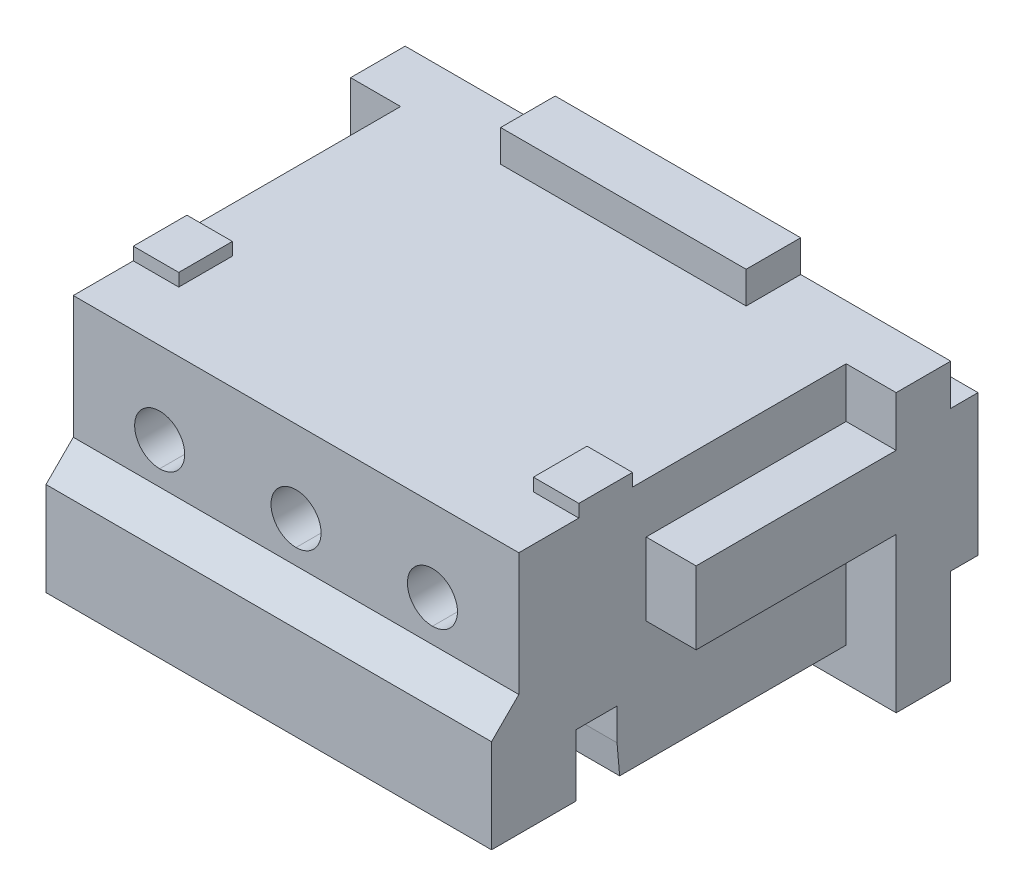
ISO-10303-21;
HEADER;
FILE_DESCRIPTION(('STEP AP214'),'2;1');
FILE_NAME('part.step','',(''),(''),'','','');
FILE_SCHEMA(('AUTOMOTIVE_DESIGN { 1 0 10303 214 1 1 1 1 }'));
ENDSEC;
DATA;
#1=APPLICATION_CONTEXT('core data for automotive mechanical design processes');
#2=APPLICATION_PROTOCOL_DEFINITION('international standard','automotive_design',2000,#1);
#3=PRODUCT_CONTEXT('',#1,'mechanical');
#4=PRODUCT('Part','Part','',(#3));
#5=PRODUCT_RELATED_PRODUCT_CATEGORY('part','',(#4));
#6=PRODUCT_DEFINITION_FORMATION('','',#4);
#7=PRODUCT_DEFINITION_CONTEXT('part definition',#1,'design');
#8=PRODUCT_DEFINITION('design','',#6,#7);
#9=PRODUCT_DEFINITION_SHAPE('','',#8);
#10=(LENGTH_UNIT() NAMED_UNIT(*) SI_UNIT(.MILLI.,.METRE.));
#11=(NAMED_UNIT(*) PLANE_ANGLE_UNIT() SI_UNIT($,.RADIAN.));
#12=(NAMED_UNIT(*) SI_UNIT($,.STERADIAN.) SOLID_ANGLE_UNIT());
#13=UNCERTAINTY_MEASURE_WITH_UNIT(LENGTH_MEASURE(1.E-05),#10,'distance_accuracy_value','');
#14=(GEOMETRIC_REPRESENTATION_CONTEXT(3) GLOBAL_UNCERTAINTY_ASSIGNED_CONTEXT((#13)) GLOBAL_UNIT_ASSIGNED_CONTEXT((#10,
#11,#12)) REPRESENTATION_CONTEXT('',''));
#15=CARTESIAN_POINT('',(0.,0.,0.));
#16=DIRECTION('',(0.,0.,1.));
#17=DIRECTION('',(1.,0.,0.));
#18=AXIS2_PLACEMENT_3D('',#15,#16,#17);
#19=CARTESIAN_POINT('',(0.415783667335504,0.998321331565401,-1.80167866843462));
#20=DIRECTION('',(0.,-1.,0.));
#21=DIRECTION('',(0.,0.,-1.));
#22=AXIS2_PLACEMENT_3D('',#19,#20,#21);
#23=PLANE('',#22);
#24=DIRECTION('',(0.,0.,-1.));
#25=VECTOR('',#24,1.);
#26=CARTESIAN_POINT('',(-0.704216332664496,0.998321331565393,-1.80167866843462));
#27=LINE('',#26,#25);
#28=CARTESIAN_POINT('',(-0.704216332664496,0.998321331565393,-1.80167866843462));
#29=VERTEX_POINT('',#28);
#30=CARTESIAN_POINT('',(-0.704216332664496,0.998321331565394,-2.10167866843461));
#31=VERTEX_POINT('',#30);
#32=EDGE_CURVE('E1156',#29,#31,#27,.T.);
#33=ORIENTED_EDGE('',*,*,#32,.F.);
#34=DIRECTION('',(-1.,0.,0.));
#35=VECTOR('',#34,1.);
#36=CARTESIAN_POINT('',(0.415783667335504,0.998321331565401,-1.80167866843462));
#37=LINE('',#36,#35);
#38=CARTESIAN_POINT('',(0.415783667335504,0.998321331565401,-1.80167866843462));
#39=VERTEX_POINT('',#38);
#40=EDGE_CURVE('E28',#39,#29,#37,.T.);
#41=ORIENTED_EDGE('',*,*,#40,.F.);
#42=DIRECTION('',(0.,0.,-1.));
#43=VECTOR('',#42,1.);
#44=CARTESIAN_POINT('',(0.415783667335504,0.998321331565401,-1.80167866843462));
#45=LINE('',#44,#43);
#46=CARTESIAN_POINT('',(0.415783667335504,0.998321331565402,-2.10167866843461));
#47=VERTEX_POINT('',#46);
#48=EDGE_CURVE('E1199',#39,#47,#45,.T.);
#49=ORIENTED_EDGE('',*,*,#48,.T.);
#50=DIRECTION('',(1.,0.,0.));
#51=VECTOR('',#50,1.);
#52=CARTESIAN_POINT('',(-3.14421633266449,0.998321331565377,-2.10167866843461));
#53=LINE('',#52,#51);
#54=EDGE_CURVE('E1108',#31,#47,#53,.T.);
#55=ORIENTED_EDGE('',*,*,#54,.F.);
#56=EDGE_LOOP('',(#33,#41,#49,#55));
#57=FACE_BOUND('',#56,.T.);
#58=ADVANCED_FACE('F18',(#57),#23,.F.);
#59=CARTESIAN_POINT('',(-3.14421633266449,0.998321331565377,-2.10167866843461));
#60=DIRECTION('',(0.,1.,0.));
#61=DIRECTION('',(1.,0.,0.));
#62=AXIS2_PLACEMENT_3D('',#59,#60,#61);
#63=PLANE('',#62);
#64=DIRECTION('',(1.,0.,0.));
#65=VECTOR('',#64,1.);
#66=CARTESIAN_POINT('',(-3.14421633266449,0.998321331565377,-2.10167866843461));
#67=LINE('',#66,#65);
#68=CARTESIAN_POINT('',(-1.0842163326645,0.998321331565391,-2.10167866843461));
#69=VERTEX_POINT('',#68);
#70=EDGE_CURVE('E1104',#69,#31,#67,.T.);
#71=ORIENTED_EDGE('',*,*,#70,.F.);
#72=DIRECTION('',(0.,0.,-1.));
#73=VECTOR('',#72,1.);
#74=CARTESIAN_POINT('',(-1.0842163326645,0.99832133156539,-1.80167866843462));
#75=LINE('',#74,#73);
#76=CARTESIAN_POINT('',(-1.0842163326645,0.998321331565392,-2.40167866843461));
#77=VERTEX_POINT('',#76);
#78=EDGE_CURVE('E1163',#69,#77,#75,.T.);
#79=ORIENTED_EDGE('',*,*,#78,.T.);
#80=DIRECTION('',(1.,0.,0.));
#81=VECTOR('',#80,1.);
#82=CARTESIAN_POINT('',(-3.14421633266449,0.998321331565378,-2.40167866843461));
#83=LINE('',#82,#81);
#84=CARTESIAN_POINT('',(-0.704216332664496,0.998321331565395,-2.40167866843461));
#85=VERTEX_POINT('',#84);
#86=EDGE_CURVE('E1142',#77,#85,#83,.T.);
#87=ORIENTED_EDGE('',*,*,#86,.T.);
#88=DIRECTION('',(0.,0.,-1.));
#89=VECTOR('',#88,1.);
#90=CARTESIAN_POINT('',(-0.704216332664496,0.998321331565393,-1.80167866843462));
#91=LINE('',#90,#89);
#92=EDGE_CURVE('E1160',#31,#85,#91,.T.);
#93=ORIENTED_EDGE('',*,*,#92,.F.);
#94=EDGE_LOOP('',(#71,#79,#87,#93));
#95=FACE_BOUND('',#94,.T.);
#96=ADVANCED_FACE('F2840',(#95),#63,.F.);
#97=CARTESIAN_POINT('',(-3.14421633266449,0.998321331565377,-2.10167866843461));
#98=DIRECTION('',(0.,1.,0.));
#99=DIRECTION('',(1.,0.,0.));
#100=AXIS2_PLACEMENT_3D('',#97,#98,#99);
#101=PLANE('',#100);
#102=DIRECTION('',(1.,0.,0.));
#103=VECTOR('',#102,1.);
#104=CARTESIAN_POINT('',(-3.14421633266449,0.998321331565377,-2.10167866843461));
#105=LINE('',#104,#103);
#106=CARTESIAN_POINT('',(0.795783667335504,0.998321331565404,-2.10167866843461));
#107=VERTEX_POINT('',#106);
#108=EDGE_CURVE('E1112',#47,#107,#105,.T.);
#109=ORIENTED_EDGE('',*,*,#108,.F.);
#110=DIRECTION('',(0.,0.,-1.));
#111=VECTOR('',#110,1.);
#112=CARTESIAN_POINT('',(0.415783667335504,0.998321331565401,-1.80167866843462));
#113=LINE('',#112,#111);
#114=CARTESIAN_POINT('',(0.415783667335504,0.998321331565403,-2.40167866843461));
#115=VERTEX_POINT('',#114);
#116=EDGE_CURVE('E1195',#47,#115,#113,.T.);
#117=ORIENTED_EDGE('',*,*,#116,.T.);
#118=DIRECTION('',(1.,0.,0.));
#119=VECTOR('',#118,1.);
#120=CARTESIAN_POINT('',(-3.14421633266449,0.998321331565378,-2.40167866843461));
#121=LINE('',#120,#119);
#122=CARTESIAN_POINT('',(0.795783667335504,0.998321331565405,-2.40167866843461));
#123=VERTEX_POINT('',#122);
#124=EDGE_CURVE('E11',#115,#123,#121,.T.);
#125=ORIENTED_EDGE('',*,*,#124,.T.);
#126=DIRECTION('',(0.,0.,-1.));
#127=VECTOR('',#126,1.);
#128=CARTESIAN_POINT('',(0.795783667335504,0.998321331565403,-1.80167866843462));
#129=LINE('',#128,#127);
#130=EDGE_CURVE('E721',#107,#123,#129,.T.);
#131=ORIENTED_EDGE('',*,*,#130,.F.);
#132=EDGE_LOOP('',(#109,#117,#125,#131));
#133=FACE_BOUND('',#132,.T.);
#134=ADVANCED_FACE('F2719',(#133),#101,.F.);
#135=CARTESIAN_POINT('',(-1.0842163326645,0.99832133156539,-1.80167866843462));
#136=DIRECTION('',(0.,-1.,0.));
#137=DIRECTION('',(0.,0.,-1.));
#138=AXIS2_PLACEMENT_3D('',#135,#136,#137);
#139=PLANE('',#138);
#140=DIRECTION('',(0.,0.,-1.));
#141=VECTOR('',#140,1.);
#142=CARTESIAN_POINT('',(-2.2042163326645,0.998321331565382,-1.80167866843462));
#143=LINE('',#142,#141);
#144=CARTESIAN_POINT('',(-2.2042163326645,0.998321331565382,-1.80167866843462));
#145=VERTEX_POINT('',#144);
#146=CARTESIAN_POINT('',(-2.2042163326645,0.998321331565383,-2.10167866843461));
#147=VERTEX_POINT('',#146);
#148=EDGE_CURVE('E1139',#145,#147,#143,.T.);
#149=ORIENTED_EDGE('',*,*,#148,.F.);
#150=DIRECTION('',(-1.,0.,0.));
#151=VECTOR('',#150,1.);
#152=CARTESIAN_POINT('',(-1.0842163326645,0.99832133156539,-1.80167866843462));
#153=LINE('',#152,#151);
#154=CARTESIAN_POINT('',(-1.0842163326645,0.99832133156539,-1.80167866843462));
#155=VERTEX_POINT('',#154);
#156=EDGE_CURVE('E519',#155,#145,#153,.T.);
#157=ORIENTED_EDGE('',*,*,#156,.F.);
#158=DIRECTION('',(0.,0.,-1.));
#159=VECTOR('',#158,1.);
#160=CARTESIAN_POINT('',(-1.0842163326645,0.99832133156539,-1.80167866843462));
#161=LINE('',#160,#159);
#162=EDGE_CURVE('E1166',#155,#69,#161,.T.);
#163=ORIENTED_EDGE('',*,*,#162,.T.);
#164=DIRECTION('',(1.,0.,0.));
#165=VECTOR('',#164,1.);
#166=CARTESIAN_POINT('',(-3.14421633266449,0.998321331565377,-2.10167866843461));
#167=LINE('',#166,#165);
#168=EDGE_CURVE('E1103',#147,#69,#167,.T.);
#169=ORIENTED_EDGE('',*,*,#168,.F.);
#170=EDGE_LOOP('',(#149,#157,#163,#169));
#171=FACE_BOUND('',#170,.T.);
#172=ADVANCED_FACE('F2715',(#171),#139,.F.);
#173=CARTESIAN_POINT('',(1.91578366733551,0.998321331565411,-1.80167866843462));
#174=DIRECTION('',(0.,-1.,0.));
#175=DIRECTION('',(0.,0.,-1.));
#176=AXIS2_PLACEMENT_3D('',#173,#174,#175);
#177=PLANE('',#176);
#178=DIRECTION('',(0.,0.,-1.));
#179=VECTOR('',#178,1.);
#180=CARTESIAN_POINT('',(0.795783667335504,0.998321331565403,-1.80167866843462));
#181=LINE('',#180,#179);
#182=CARTESIAN_POINT('',(0.795783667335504,0.998321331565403,-1.80167866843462));
#183=VERTEX_POINT('',#182);
#184=EDGE_CURVE('E717',#183,#107,#181,.T.);
#185=ORIENTED_EDGE('',*,*,#184,.F.);
#186=DIRECTION('',(-1.,0.,0.));
#187=VECTOR('',#186,1.);
#188=CARTESIAN_POINT('',(1.91578366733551,0.998321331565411,-1.80167866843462));
#189=LINE('',#188,#187);
#190=CARTESIAN_POINT('',(1.91578366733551,0.998321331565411,-1.80167866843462));
#191=VERTEX_POINT('',#190);
#192=EDGE_CURVE('E1176',#191,#183,#189,.T.);
#193=ORIENTED_EDGE('',*,*,#192,.F.);
#194=DIRECTION('',(0.,0.,-1.));
#195=VECTOR('',#194,1.);
#196=CARTESIAN_POINT('',(1.91578366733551,0.998321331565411,-1.80167866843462));
#197=LINE('',#196,#195);
#198=CARTESIAN_POINT('',(1.91578366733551,0.998321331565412,-2.10167866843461));
#199=VERTEX_POINT('',#198);
#200=EDGE_CURVE('E1188',#191,#199,#197,.T.);
#201=ORIENTED_EDGE('',*,*,#200,.T.);
#202=DIRECTION('',(1.,0.,0.));
#203=VECTOR('',#202,1.);
#204=CARTESIAN_POINT('',(-3.14421633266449,0.998321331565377,-2.10167866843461));
#205=LINE('',#204,#203);
#206=EDGE_CURVE('E1116',#107,#199,#205,.T.);
#207=ORIENTED_EDGE('',*,*,#206,.F.);
#208=EDGE_LOOP('',(#185,#193,#201,#207));
#209=FACE_BOUND('',#208,.T.);
#210=ADVANCED_FACE('F20',(#209),#177,.F.);
#211=CARTESIAN_POINT('',(-3.14421633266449,0.998321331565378,-2.40167866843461));
#212=DIRECTION('',(0.,0.,1.));
#213=DIRECTION('',(0.,-1.,0.));
#214=AXIS2_PLACEMENT_3D('',#211,#212,#213);
#215=PLANE('',#214);
#216=ORIENTED_EDGE('',*,*,#124,.F.);
#217=DIRECTION('',(0.,-1.,0.));
#218=VECTOR('',#217,1.);
#219=CARTESIAN_POINT('',(0.415783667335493,2.5483213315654,-2.40167866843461));
#220=LINE('',#219,#218);
#221=CARTESIAN_POINT('',(0.415783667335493,2.5483213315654,-2.40167866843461));
#222=VERTEX_POINT('',#221);
#223=EDGE_CURVE('E1191',#222,#115,#220,.T.);
#224=ORIENTED_EDGE('',*,*,#223,.F.);
#225=DIRECTION('',(1.,0.,0.));
#226=VECTOR('',#225,1.);
#227=CARTESIAN_POINT('',(-3.1442163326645,2.54832133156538,-2.40167866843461));
#228=LINE('',#227,#226);
#229=CARTESIAN_POINT('',(0.795783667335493,2.5483213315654,-2.40167866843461));
#230=VERTEX_POINT('',#229);
#231=EDGE_CURVE('E1080',#222,#230,#228,.T.);
#232=ORIENTED_EDGE('',*,*,#231,.T.);
#233=DIRECTION('',(0.,1.,0.));
#234=VECTOR('',#233,1.);
#235=CARTESIAN_POINT('',(0.795783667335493,2.5483213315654,-2.40167866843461));
#236=LINE('',#235,#234);
#237=EDGE_CURVE('E722',#123,#230,#236,.T.);
#238=ORIENTED_EDGE('',*,*,#237,.F.);
#239=EDGE_LOOP('',(#216,#224,#232,#238));
#240=FACE_BOUND('',#239,.T.);
#241=ADVANCED_FACE('F3284',(#240),#215,.F.);
#242=CARTESIAN_POINT('',(0.415783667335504,0.998321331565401,-1.80167866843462));
#243=DIRECTION('',(0.,0.,-1.));
#244=DIRECTION('',(-1.,0.,0.));
#245=AXIS2_PLACEMENT_3D('',#242,#243,#244);
#246=PLANE('',#245);
#247=DIRECTION('',(0.,-1.,0.));
#248=VECTOR('',#247,1.);
#249=CARTESIAN_POINT('',(0.415783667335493,2.5483213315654,-1.80167866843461));
#250=LINE('',#249,#248);
#251=CARTESIAN_POINT('',(0.415783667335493,2.5483213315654,-1.80167866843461));
#252=VERTEX_POINT('',#251);
#253=EDGE_CURVE('E1202',#252,#39,#250,.T.);
#254=ORIENTED_EDGE('',*,*,#253,.T.);
#255=ORIENTED_EDGE('',*,*,#40,.T.);
#256=DIRECTION('',(0.,1.,0.));
#257=VECTOR('',#256,1.);
#258=CARTESIAN_POINT('',(-0.704216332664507,2.5483213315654,-1.80167866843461));
#259=LINE('',#258,#257);
#260=CARTESIAN_POINT('',(-0.704216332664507,2.5483213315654,-1.80167866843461));
#261=VERTEX_POINT('',#260);
#262=EDGE_CURVE('E1153',#29,#261,#259,.T.);
#263=ORIENTED_EDGE('',*,*,#262,.T.);
#264=DIRECTION('',(1.,0.,0.));
#265=VECTOR('',#264,1.);
#266=CARTESIAN_POINT('',(0.415783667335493,2.5483213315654,-1.80167866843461));
#267=LINE('',#266,#265);
#268=EDGE_CURVE('E990',#261,#252,#267,.T.);
#269=ORIENTED_EDGE('',*,*,#268,.T.);
#270=EDGE_LOOP('',(#254,#255,#263,#269));
#271=FACE_BOUND('',#270,.T.);
#272=ADVANCED_FACE('F3288',(#271),#246,.T.);
#273=CARTESIAN_POINT('',(0.415783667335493,2.5483213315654,-1.80167866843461));
#274=DIRECTION('',(1.,0.,0.));
#275=DIRECTION('',(0.,1.,0.));
#276=AXIS2_PLACEMENT_3D('',#273,#274,#275);
#277=PLANE('',#276);
#278=ORIENTED_EDGE('',*,*,#223,.T.);
#279=ORIENTED_EDGE('',*,*,#116,.F.);
#280=ORIENTED_EDGE('',*,*,#48,.F.);
#281=ORIENTED_EDGE('',*,*,#253,.F.);
#282=DIRECTION('',(0.,0.,-1.));
#283=VECTOR('',#282,1.);
#284=CARTESIAN_POINT('',(0.415783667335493,2.5483213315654,-1.80167866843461));
#285=LINE('',#284,#283);
#286=CARTESIAN_POINT('',(0.415783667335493,2.5483213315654,-2.10167866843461));
#287=VERTEX_POINT('',#286);
#288=EDGE_CURVE('E986',#252,#287,#285,.T.);
#289=ORIENTED_EDGE('',*,*,#288,.T.);
#290=DIRECTION('',(0.,0.,-1.));
#291=VECTOR('',#290,1.);
#292=CARTESIAN_POINT('',(0.415783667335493,2.5483213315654,-1.80167866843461));
#293=LINE('',#292,#291);
#294=EDGE_CURVE('E1084',#287,#222,#293,.T.);
#295=ORIENTED_EDGE('',*,*,#294,.T.);
#296=EDGE_LOOP('',(#278,#279,#280,#281,#289,#295));
#297=FACE_BOUND('',#296,.T.);
#298=ADVANCED_FACE('F3275',(#297),#277,.F.);
#299=CARTESIAN_POINT('',(-1.0842163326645,0.99832133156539,-1.80167866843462));
#300=DIRECTION('',(0.,0.,-1.));
#301=DIRECTION('',(-1.,0.,0.));
#302=AXIS2_PLACEMENT_3D('',#299,#300,#301);
#303=PLANE('',#302);
#304=DIRECTION('',(0.,-1.,0.));
#305=VECTOR('',#304,1.);
#306=CARTESIAN_POINT('',(-1.08421633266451,2.54832133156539,-1.80167866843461));
#307=LINE('',#306,#305);
#308=CARTESIAN_POINT('',(-1.08421633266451,2.54832133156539,-1.80167866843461));
#309=VERTEX_POINT('',#308);
#310=EDGE_CURVE('E1169',#309,#155,#307,.T.);
#311=ORIENTED_EDGE('',*,*,#310,.T.);
#312=ORIENTED_EDGE('',*,*,#156,.T.);
#313=DIRECTION('',(0.,1.,0.));
#314=VECTOR('',#313,1.);
#315=CARTESIAN_POINT('',(-2.20421633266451,2.54832133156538,-1.80167866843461));
#316=LINE('',#315,#314);
#317=CARTESIAN_POINT('',(-2.20421633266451,2.54832133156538,-1.80167866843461));
#318=VERTEX_POINT('',#317);
#319=EDGE_CURVE('E1136',#145,#318,#316,.T.);
#320=ORIENTED_EDGE('',*,*,#319,.T.);
#321=DIRECTION('',(1.,0.,0.));
#322=VECTOR('',#321,1.);
#323=CARTESIAN_POINT('',(-1.08421633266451,2.54832133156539,-1.80167866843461));
#324=LINE('',#323,#322);
#325=EDGE_CURVE('E1061',#318,#309,#324,.T.);
#326=ORIENTED_EDGE('',*,*,#325,.T.);
#327=EDGE_LOOP('',(#311,#312,#320,#326));
#328=FACE_BOUND('',#327,.T.);
#329=ADVANCED_FACE('F3263',(#328),#303,.T.);
#330=CARTESIAN_POINT('',(1.9157836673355,2.54832133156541,-1.80167866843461));
#331=DIRECTION('',(1.,0.,0.));
#332=DIRECTION('',(0.,1.,0.));
#333=AXIS2_PLACEMENT_3D('',#330,#331,#332);
#334=PLANE('',#333);
#335=DIRECTION('',(0.,-1.,0.));
#336=VECTOR('',#335,1.);
#337=CARTESIAN_POINT('',(1.9157836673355,2.54832133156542,-2.40167866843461));
#338=LINE('',#337,#336);
#339=CARTESIAN_POINT('',(1.9157836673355,2.54832133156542,-2.40167866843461));
#340=VERTEX_POINT('',#339);
#341=CARTESIAN_POINT('',(1.91578366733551,0.998321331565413,-2.40167866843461));
#342=VERTEX_POINT('',#341);
#343=EDGE_CURVE('E1095',#340,#342,#338,.T.);
#344=ORIENTED_EDGE('',*,*,#343,.T.);
#345=DIRECTION('',(0.,0.,-1.));
#346=VECTOR('',#345,1.);
#347=CARTESIAN_POINT('',(1.91578366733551,0.998321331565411,-1.80167866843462));
#348=LINE('',#347,#346);
#349=EDGE_CURVE('E1123',#199,#342,#348,.T.);
#350=ORIENTED_EDGE('',*,*,#349,.F.);
#351=ORIENTED_EDGE('',*,*,#200,.F.);
#352=DIRECTION('',(0.,-1.,0.));
#353=VECTOR('',#352,1.);
#354=CARTESIAN_POINT('',(1.9157836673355,2.54832133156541,-1.80167866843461));
#355=LINE('',#354,#353);
#356=CARTESIAN_POINT('',(1.9157836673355,2.54832133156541,-1.80167866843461));
#357=VERTEX_POINT('',#356);
#358=EDGE_CURVE('E1172',#357,#191,#355,.T.);
#359=ORIENTED_EDGE('',*,*,#358,.F.);
#360=DIRECTION('',(0.,0.,-1.));
#361=VECTOR('',#360,1.);
#362=CARTESIAN_POINT('',(1.9157836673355,2.54832133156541,-1.80167866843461));
#363=LINE('',#362,#361);
#364=CARTESIAN_POINT('',(1.9157836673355,2.54832133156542,-2.10167866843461));
#365=VERTEX_POINT('',#364);
#366=EDGE_CURVE('E1046',#357,#365,#363,.T.);
#367=ORIENTED_EDGE('',*,*,#366,.T.);
#368=DIRECTION('',(0.,0.,-1.));
#369=VECTOR('',#368,1.);
#370=CARTESIAN_POINT('',(1.9157836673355,2.54832133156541,-1.80167866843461));
#371=LINE('',#370,#369);
#372=EDGE_CURVE('E1076',#365,#340,#371,.T.);
#373=ORIENTED_EDGE('',*,*,#372,.T.);
#374=EDGE_LOOP('',(#344,#350,#351,#359,#367,#373));
#375=FACE_BOUND('',#374,.T.);
#376=ADVANCED_FACE('F3251',(#375),#334,.F.);
#377=CARTESIAN_POINT('',(0.795783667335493,2.5483213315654,-1.80167866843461));
#378=DIRECTION('',(-1.,0.,0.));
#379=DIRECTION('',(0.,1.,0.));
#380=AXIS2_PLACEMENT_3D('',#377,#378,#379);
#381=PLANE('',#380);
#382=ORIENTED_EDGE('',*,*,#237,.T.);
#383=DIRECTION('',(0.,0.,-1.));
#384=VECTOR('',#383,1.);
#385=CARTESIAN_POINT('',(0.795783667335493,2.5483213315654,-1.80167866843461));
#386=LINE('',#385,#384);
#387=CARTESIAN_POINT('',(0.795783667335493,2.5483213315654,-2.10167866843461));
#388=VERTEX_POINT('',#387);
#389=EDGE_CURVE('E1088',#388,#230,#386,.T.);
#390=ORIENTED_EDGE('',*,*,#389,.F.);
#391=DIRECTION('',(0.,0.,-1.));
#392=VECTOR('',#391,1.);
#393=CARTESIAN_POINT('',(0.795783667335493,2.5483213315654,-1.80167866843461));
#394=LINE('',#393,#392);
#395=CARTESIAN_POINT('',(0.795783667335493,2.5483213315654,-1.80167866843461));
#396=VERTEX_POINT('',#395);
#397=EDGE_CURVE('E1054',#396,#388,#394,.T.);
#398=ORIENTED_EDGE('',*,*,#397,.F.);
#399=DIRECTION('',(0.,1.,0.));
#400=VECTOR('',#399,1.);
#401=CARTESIAN_POINT('',(0.795783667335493,2.5483213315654,-1.80167866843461));
#402=LINE('',#401,#400);
#403=EDGE_CURVE('E1180',#183,#396,#402,.T.);
#404=ORIENTED_EDGE('',*,*,#403,.F.);
#405=ORIENTED_EDGE('',*,*,#184,.T.);
#406=ORIENTED_EDGE('',*,*,#130,.T.);
#407=EDGE_LOOP('',(#382,#390,#398,#404,#405,#406));
#408=FACE_BOUND('',#407,.T.);
#409=ADVANCED_FACE('F2934',(#408),#381,.F.);
#410=CARTESIAN_POINT('',(1.91578366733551,0.998321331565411,-1.80167866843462));
#411=DIRECTION('',(0.,0.,-1.));
#412=DIRECTION('',(-1.,0.,0.));
#413=AXIS2_PLACEMENT_3D('',#410,#411,#412);
#414=PLANE('',#413);
#415=ORIENTED_EDGE('',*,*,#358,.T.);
#416=ORIENTED_EDGE('',*,*,#192,.T.);
#417=ORIENTED_EDGE('',*,*,#403,.T.);
#418=DIRECTION('',(1.,0.,0.));
#419=VECTOR('',#418,1.);
#420=CARTESIAN_POINT('',(1.9157836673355,2.54832133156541,-1.80167866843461));
#421=LINE('',#420,#419);
#422=EDGE_CURVE('E1050',#396,#357,#421,.T.);
#423=ORIENTED_EDGE('',*,*,#422,.T.);
#424=EDGE_LOOP('',(#415,#416,#417,#423));
#425=FACE_BOUND('',#424,.T.);
#426=ADVANCED_FACE('F2929',(#425),#414,.T.);
#427=CARTESIAN_POINT('',(-1.08421633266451,2.54832133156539,-1.80167866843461));
#428=DIRECTION('',(1.,0.,0.));
#429=DIRECTION('',(0.,1.,0.));
#430=AXIS2_PLACEMENT_3D('',#427,#428,#429);
#431=PLANE('',#430);
#432=DIRECTION('',(0.,-1.,0.));
#433=VECTOR('',#432,1.);
#434=CARTESIAN_POINT('',(-1.08421633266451,2.5483213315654,-2.40167866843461));
#435=LINE('',#434,#433);
#436=CARTESIAN_POINT('',(-1.08421633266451,2.5483213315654,-2.40167866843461));
#437=VERTEX_POINT('',#436);
#438=EDGE_CURVE('E1146',#437,#77,#435,.T.);
#439=ORIENTED_EDGE('',*,*,#438,.T.);
#440=ORIENTED_EDGE('',*,*,#78,.F.);
#441=ORIENTED_EDGE('',*,*,#162,.F.);
#442=ORIENTED_EDGE('',*,*,#310,.F.);
#443=DIRECTION('',(0.,0.,-1.));
#444=VECTOR('',#443,1.);
#445=CARTESIAN_POINT('',(-1.08421633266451,2.54832133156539,-1.80167866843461));
#446=LINE('',#445,#444);
#447=CARTESIAN_POINT('',(-1.08421633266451,2.54832133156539,-2.10167866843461));
#448=VERTEX_POINT('',#447);
#449=EDGE_CURVE('E1058',#309,#448,#446,.T.);
#450=ORIENTED_EDGE('',*,*,#449,.T.);
#451=DIRECTION('',(0.,0.,-1.));
#452=VECTOR('',#451,1.);
#453=CARTESIAN_POINT('',(-1.08421633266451,2.54832133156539,-1.80167866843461));
#454=LINE('',#453,#452);
#455=EDGE_CURVE('E1038',#448,#437,#454,.T.);
#456=ORIENTED_EDGE('',*,*,#455,.T.);
#457=EDGE_LOOP('',(#439,#440,#441,#442,#450,#456));
#458=FACE_BOUND('',#457,.T.);
#459=ADVANCED_FACE('F2933',(#458),#431,.F.);
#460=CARTESIAN_POINT('',(-0.704216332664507,2.5483213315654,-1.80167866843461));
#461=DIRECTION('',(-1.,0.,0.));
#462=DIRECTION('',(0.,1.,0.));
#463=AXIS2_PLACEMENT_3D('',#460,#461,#462);
#464=PLANE('',#463);
#465=DIRECTION('',(0.,1.,0.));
#466=VECTOR('',#465,1.);
#467=CARTESIAN_POINT('',(-0.704216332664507,2.5483213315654,-2.40167866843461));
#468=LINE('',#467,#466);
#469=CARTESIAN_POINT('',(-0.704216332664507,2.5483213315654,-2.40167866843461));
#470=VERTEX_POINT('',#469);
#471=EDGE_CURVE('E1150',#85,#470,#468,.T.);
#472=ORIENTED_EDGE('',*,*,#471,.T.);
#473=DIRECTION('',(0.,0.,-1.));
#474=VECTOR('',#473,1.);
#475=CARTESIAN_POINT('',(-0.704216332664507,2.5483213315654,-1.80167866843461));
#476=LINE('',#475,#474);
#477=CARTESIAN_POINT('',(-0.704216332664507,2.5483213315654,-2.10167866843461));
#478=VERTEX_POINT('',#477);
#479=EDGE_CURVE('E1042',#478,#470,#476,.T.);
#480=ORIENTED_EDGE('',*,*,#479,.F.);
#481=DIRECTION('',(0.,0.,-1.));
#482=VECTOR('',#481,1.);
#483=CARTESIAN_POINT('',(-0.704216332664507,2.5483213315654,-1.80167866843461));
#484=LINE('',#483,#482);
#485=EDGE_CURVE('E1070',#261,#478,#484,.T.);
#486=ORIENTED_EDGE('',*,*,#485,.F.);
#487=ORIENTED_EDGE('',*,*,#262,.F.);
#488=ORIENTED_EDGE('',*,*,#32,.T.);
#489=ORIENTED_EDGE('',*,*,#92,.T.);
#490=EDGE_LOOP('',(#472,#480,#486,#487,#488,#489));
#491=FACE_BOUND('',#490,.T.);
#492=ADVANCED_FACE('F3076',(#491),#464,.F.);
#493=CARTESIAN_POINT('',(-3.14421633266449,0.998321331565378,-2.40167866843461));
#494=DIRECTION('',(0.,0.,1.));
#495=DIRECTION('',(0.,-1.,0.));
#496=AXIS2_PLACEMENT_3D('',#493,#494,#495);
#497=PLANE('',#496);
#498=ORIENTED_EDGE('',*,*,#86,.F.);
#499=ORIENTED_EDGE('',*,*,#438,.F.);
#500=DIRECTION('',(1.,0.,0.));
#501=VECTOR('',#500,1.);
#502=CARTESIAN_POINT('',(-3.1442163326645,2.54832133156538,-2.40167866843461));
#503=LINE('',#502,#501);
#504=EDGE_CURVE('E1034',#437,#470,#503,.T.);
#505=ORIENTED_EDGE('',*,*,#504,.T.);
#506=ORIENTED_EDGE('',*,*,#471,.F.);
#507=EDGE_LOOP('',(#498,#499,#505,#506));
#508=FACE_BOUND('',#507,.T.);
#509=ADVANCED_FACE('F3085',(#508),#497,.F.);
#510=CARTESIAN_POINT('',(-2.20421633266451,2.54832133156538,-1.80167866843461));
#511=DIRECTION('',(-1.,0.,0.));
#512=DIRECTION('',(0.,1.,0.));
#513=AXIS2_PLACEMENT_3D('',#510,#511,#512);
#514=PLANE('',#513);
#515=DIRECTION('',(0.,1.,0.));
#516=VECTOR('',#515,1.);
#517=CARTESIAN_POINT('',(-2.20421633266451,2.54832133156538,-2.40167866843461));
#518=LINE('',#517,#516);
#519=CARTESIAN_POINT('',(-2.2042163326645,0.998321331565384,-2.40167866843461));
#520=VERTEX_POINT('',#519);
#521=CARTESIAN_POINT('',(-2.20421633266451,2.54832133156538,-2.40167866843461));
#522=VERTEX_POINT('',#521);
#523=EDGE_CURVE('E1126',#520,#522,#518,.T.);
#524=ORIENTED_EDGE('',*,*,#523,.T.);
#525=DIRECTION('',(0.,0.,-1.));
#526=VECTOR('',#525,1.);
#527=CARTESIAN_POINT('',(-2.20421633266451,2.54832133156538,-1.80167866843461));
#528=LINE('',#527,#526);
#529=CARTESIAN_POINT('',(-2.20421633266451,2.54832133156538,-2.10167866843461));
#530=VERTEX_POINT('',#529);
#531=EDGE_CURVE('E1026',#530,#522,#528,.T.);
#532=ORIENTED_EDGE('',*,*,#531,.F.);
#533=DIRECTION('',(0.,0.,-1.));
#534=VECTOR('',#533,1.);
#535=CARTESIAN_POINT('',(-2.20421633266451,2.54832133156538,-1.80167866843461));
#536=LINE('',#535,#534);
#537=EDGE_CURVE('E991',#318,#530,#536,.T.);
#538=ORIENTED_EDGE('',*,*,#537,.F.);
#539=ORIENTED_EDGE('',*,*,#319,.F.);
#540=ORIENTED_EDGE('',*,*,#148,.T.);
#541=DIRECTION('',(0.,0.,-1.));
#542=VECTOR('',#541,1.);
#543=CARTESIAN_POINT('',(-2.2042163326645,0.998321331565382,-1.80167866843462));
#544=LINE('',#543,#542);
#545=EDGE_CURVE('E1133',#147,#520,#544,.T.);
#546=ORIENTED_EDGE('',*,*,#545,.T.);
#547=EDGE_LOOP('',(#524,#532,#538,#539,#540,#546));
#548=FACE_BOUND('',#547,.T.);
#549=ADVANCED_FACE('F3089',(#548),#514,.F.);
#550=CARTESIAN_POINT('',(1.3557836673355,2.0983213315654,1.69832133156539));
#551=DIRECTION('',(0.,0.,1.));
#552=DIRECTION('',(0.,-1.,0.));
#553=AXIS2_PLACEMENT_3D('',#550,#551,#552);
#554=PLANE('',#553);
#555=CARTESIAN_POINT('',(1.3557836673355,2.0983213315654,1.69832133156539));
#556=DIRECTION('',(0.,0.,1.));
#557=DIRECTION('',(0.,1.,0.));
#558=AXIS2_PLACEMENT_3D('',#555,#556,#557);
#559=CIRCLE('',#558,0.275);
#560=CARTESIAN_POINT('',(1.35578366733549,2.37332133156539,1.69832133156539));
#561=VERTEX_POINT('',#560);
#562=CARTESIAN_POINT('',(1.3557836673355,1.82332133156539,1.69832133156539));
#563=VERTEX_POINT('',#562);
#564=EDGE_CURVE('E1013',#561,#563,#559,.T.);
#565=ORIENTED_EDGE('',*,*,#564,.T.);
#566=CARTESIAN_POINT('',(1.3557836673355,2.0983213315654,1.69832133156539));
#567=DIRECTION('',(0.,0.,1.));
#568=DIRECTION('',(0.,1.,0.));
#569=AXIS2_PLACEMENT_3D('',#566,#567,#568);
#570=CIRCLE('',#569,0.275);
#571=EDGE_CURVE('E1020',#563,#561,#570,.T.);
#572=ORIENTED_EDGE('',*,*,#571,.T.);
#573=EDGE_LOOP('',(#565,#572));
#574=FACE_BOUND('',#573,.T.);
#575=ADVANCED_FACE('F3206',(#574),#554,.T.);
#576=CARTESIAN_POINT('',(-0.144216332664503,2.09832133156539,1.69832133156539));
#577=DIRECTION('',(0.,0.,1.));
#578=DIRECTION('',(0.,-1.,0.));
#579=AXIS2_PLACEMENT_3D('',#576,#577,#578);
#580=PLANE('',#579);
#581=CARTESIAN_POINT('',(-0.144216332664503,2.09832133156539,1.69832133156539));
#582=DIRECTION('',(0.,0.,1.));
#583=DIRECTION('',(0.,1.,0.));
#584=AXIS2_PLACEMENT_3D('',#581,#582,#583);
#585=CIRCLE('',#584,0.275);
#586=CARTESIAN_POINT('',(-0.144216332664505,2.37332133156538,1.69832133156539));
#587=VERTEX_POINT('',#586);
#588=CARTESIAN_POINT('',(-0.144216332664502,1.82332133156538,1.69832133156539));
#589=VERTEX_POINT('',#588);
#590=EDGE_CURVE('E1000',#587,#589,#585,.T.);
#591=ORIENTED_EDGE('',*,*,#590,.T.);
#592=CARTESIAN_POINT('',(-0.144216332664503,2.09832133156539,1.69832133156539));
#593=DIRECTION('',(0.,0.,1.));
#594=DIRECTION('',(0.,1.,0.));
#595=AXIS2_PLACEMENT_3D('',#592,#593,#594);
#596=CIRCLE('',#595,0.275);
#597=EDGE_CURVE('E1007',#589,#587,#596,.T.);
#598=ORIENTED_EDGE('',*,*,#597,.T.);
#599=EDGE_LOOP('',(#591,#598));
#600=FACE_BOUND('',#599,.T.);
#601=ADVANCED_FACE('F3194',(#600),#580,.T.);
#602=CARTESIAN_POINT('',(-1.6442163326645,2.09832133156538,1.69832133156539));
#603=DIRECTION('',(0.,0.,1.));
#604=DIRECTION('',(0.,-1.,0.));
#605=AXIS2_PLACEMENT_3D('',#602,#603,#604);
#606=PLANE('',#605);
#607=CARTESIAN_POINT('',(-1.6442163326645,2.09832133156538,1.69832133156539));
#608=DIRECTION('',(0.,0.,1.));
#609=DIRECTION('',(0.,1.,0.));
#610=AXIS2_PLACEMENT_3D('',#607,#608,#609);
#611=CIRCLE('',#610,0.275);
#612=CARTESIAN_POINT('',(-1.6442163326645,2.37332133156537,1.69832133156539));
#613=VERTEX_POINT('',#612);
#614=CARTESIAN_POINT('',(-1.6442163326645,1.82332133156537,1.69832133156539));
#615=VERTEX_POINT('',#614);
#616=EDGE_CURVE('E771',#613,#615,#611,.T.);
#617=ORIENTED_EDGE('',*,*,#616,.T.);
#618=CARTESIAN_POINT('',(-1.6442163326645,2.09832133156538,1.69832133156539));
#619=DIRECTION('',(0.,0.,1.));
#620=DIRECTION('',(0.,1.,0.));
#621=AXIS2_PLACEMENT_3D('',#618,#619,#620);
#622=CIRCLE('',#621,0.275);
#623=EDGE_CURVE('E770',#615,#613,#622,.T.);
#624=ORIENTED_EDGE('',*,*,#623,.T.);
#625=EDGE_LOOP('',(#617,#624));
#626=FACE_BOUND('',#625,.T.);
#627=ADVANCED_FACE('F2768',(#626),#606,.T.);
#628=CARTESIAN_POINT('',(-3.14421633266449,0.998321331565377,-2.10167866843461));
#629=DIRECTION('',(0.,1.,0.));
#630=DIRECTION('',(1.,0.,0.));
#631=AXIS2_PLACEMENT_3D('',#628,#629,#630);
#632=PLANE('',#631);
#633=DIRECTION('',(1.,0.,0.));
#634=VECTOR('',#633,1.);
#635=CARTESIAN_POINT('',(-3.14421633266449,0.998321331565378,-2.40167866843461));
#636=LINE('',#635,#634);
#637=CARTESIAN_POINT('',(-3.14421633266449,0.998321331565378,-2.40167866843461));
#638=VERTEX_POINT('',#637);
#639=EDGE_CURVE('E1129',#638,#520,#636,.T.);
#640=ORIENTED_EDGE('',*,*,#639,.T.);
#641=ORIENTED_EDGE('',*,*,#545,.F.);
#642=DIRECTION('',(1.,0.,0.));
#643=VECTOR('',#642,1.);
#644=CARTESIAN_POINT('',(-3.14421633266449,0.998321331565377,-2.10167866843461));
#645=LINE('',#644,#643);
#646=CARTESIAN_POINT('',(-3.14421633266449,0.998321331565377,-2.10167866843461));
#647=VERTEX_POINT('',#646);
#648=EDGE_CURVE('E1099',#647,#147,#645,.T.);
#649=ORIENTED_EDGE('',*,*,#648,.F.);
#650=DIRECTION('',(0.,0.,1.));
#651=VECTOR('',#650,1.);
#652=CARTESIAN_POINT('',(-3.14421633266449,0.998321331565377,-2.10167866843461));
#653=LINE('',#652,#651);
#654=EDGE_CURVE('E726',#638,#647,#653,.T.);
#655=ORIENTED_EDGE('',*,*,#654,.F.);
#656=EDGE_LOOP('',(#640,#641,#649,#655));
#657=FACE_BOUND('',#656,.T.);
#658=ADVANCED_FACE('F2763',(#657),#632,.F.);
#659=CARTESIAN_POINT('',(-3.14421633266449,0.998321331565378,-2.40167866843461));
#660=DIRECTION('',(0.,0.,1.));
#661=DIRECTION('',(0.,-1.,0.));
#662=AXIS2_PLACEMENT_3D('',#659,#660,#661);
#663=PLANE('',#662);
#664=DIRECTION('',(1.,0.,0.));
#665=VECTOR('',#664,1.);
#666=CARTESIAN_POINT('',(-3.1442163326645,2.54832133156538,-2.40167866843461));
#667=LINE('',#666,#665);
#668=CARTESIAN_POINT('',(-3.1442163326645,2.54832133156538,-2.40167866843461));
#669=VERTEX_POINT('',#668);
#670=EDGE_CURVE('E1030',#669,#522,#667,.T.);
#671=ORIENTED_EDGE('',*,*,#670,.T.);
#672=ORIENTED_EDGE('',*,*,#523,.F.);
#673=ORIENTED_EDGE('',*,*,#639,.F.);
#674=DIRECTION('',(0.,-1.,0.));
#675=VECTOR('',#674,1.);
#676=CARTESIAN_POINT('',(-3.14421633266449,0.998321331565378,-2.40167866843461));
#677=LINE('',#676,#675);
#678=EDGE_CURVE('E731',#669,#638,#677,.T.);
#679=ORIENTED_EDGE('',*,*,#678,.F.);
#680=EDGE_LOOP('',(#671,#672,#673,#679));
#681=FACE_BOUND('',#680,.T.);
#682=ADVANCED_FACE('F2767',(#681),#663,.F.);
#683=CARTESIAN_POINT('',(-3.14421633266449,0.998321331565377,-2.10167866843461));
#684=DIRECTION('',(0.,1.,0.));
#685=DIRECTION('',(1.,0.,0.));
#686=AXIS2_PLACEMENT_3D('',#683,#684,#685);
#687=PLANE('',#686);
#688=DIRECTION('',(1.,0.,0.));
#689=VECTOR('',#688,1.);
#690=CARTESIAN_POINT('',(-3.14421633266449,0.998321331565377,-2.10167866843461));
#691=LINE('',#690,#689);
#692=CARTESIAN_POINT('',(2.85578366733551,0.998321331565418,-2.10167866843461));
#693=VERTEX_POINT('',#692);
#694=EDGE_CURVE('E1120',#199,#693,#691,.T.);
#695=ORIENTED_EDGE('',*,*,#694,.F.);
#696=ORIENTED_EDGE('',*,*,#349,.T.);
#697=DIRECTION('',(1.,0.,0.));
#698=VECTOR('',#697,1.);
#699=CARTESIAN_POINT('',(-3.14421633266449,0.998321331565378,-2.40167866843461));
#700=LINE('',#699,#698);
#701=CARTESIAN_POINT('',(2.85578366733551,0.99832133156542,-2.40167866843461));
#702=VERTEX_POINT('',#701);
#703=EDGE_CURVE('E1092',#342,#702,#700,.T.);
#704=ORIENTED_EDGE('',*,*,#703,.T.);
#705=DIRECTION('',(0.,0.,1.));
#706=VECTOR('',#705,1.);
#707=CARTESIAN_POINT('',(2.85578366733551,0.998321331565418,-2.10167866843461));
#708=LINE('',#707,#706);
#709=EDGE_CURVE('E960',#702,#693,#708,.T.);
#710=ORIENTED_EDGE('',*,*,#709,.T.);
#711=EDGE_LOOP('',(#695,#696,#704,#710));
#712=FACE_BOUND('',#711,.T.);
#713=ADVANCED_FACE('F3098',(#712),#687,.F.);
#714=CARTESIAN_POINT('',(-3.14421633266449,-0.0516786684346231,-2.10167866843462));
#715=DIRECTION('',(0.,0.,1.));
#716=DIRECTION('',(0.,-1.,0.));
#717=AXIS2_PLACEMENT_3D('',#714,#715,#716);
#718=PLANE('',#717);
#719=DIRECTION('',(0.,-1.,0.));
#720=VECTOR('',#719,1.);
#721=CARTESIAN_POINT('',(2.85578366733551,-0.0516786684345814,-2.10167866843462));
#722=LINE('',#721,#720);
#723=CARTESIAN_POINT('',(2.85578366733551,-0.0516786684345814,-2.10167866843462));
#724=VERTEX_POINT('',#723);
#725=EDGE_CURVE('E915',#693,#724,#722,.T.);
#726=ORIENTED_EDGE('',*,*,#725,.T.);
#727=DIRECTION('',(1.,0.,0.));
#728=VECTOR('',#727,1.);
#729=CARTESIAN_POINT('',(-3.14421633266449,-0.0516786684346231,-2.10167866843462));
#730=LINE('',#729,#728);
#731=CARTESIAN_POINT('',(-3.14421633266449,-0.0516786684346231,-2.10167866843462));
#732=VERTEX_POINT('',#731);
#733=EDGE_CURVE('E925',#732,#724,#730,.T.);
#734=ORIENTED_EDGE('',*,*,#733,.F.);
#735=DIRECTION('',(0.,-1.,0.));
#736=VECTOR('',#735,1.);
#737=CARTESIAN_POINT('',(-3.14421633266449,-0.0516786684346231,-2.10167866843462));
#738=LINE('',#737,#736);
#739=EDGE_CURVE('E730',#647,#732,#738,.T.);
#740=ORIENTED_EDGE('',*,*,#739,.F.);
#741=ORIENTED_EDGE('',*,*,#648,.T.);
#742=ORIENTED_EDGE('',*,*,#168,.T.);
#743=ORIENTED_EDGE('',*,*,#70,.T.);
#744=ORIENTED_EDGE('',*,*,#54,.T.);
#745=ORIENTED_EDGE('',*,*,#108,.T.);
#746=ORIENTED_EDGE('',*,*,#206,.T.);
#747=ORIENTED_EDGE('',*,*,#694,.T.);
#748=EDGE_LOOP('',(#726,#734,#740,#741,#742,#743,#744,#745,#746,#747));
#749=FACE_BOUND('',#748,.T.);
#750=ADVANCED_FACE('F3102',(#749),#718,.F.);
#751=CARTESIAN_POINT('',(-3.14421633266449,0.998321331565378,-2.40167866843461));
#752=DIRECTION('',(0.,0.,1.));
#753=DIRECTION('',(0.,-1.,0.));
#754=AXIS2_PLACEMENT_3D('',#751,#752,#753);
#755=PLANE('',#754);
#756=ORIENTED_EDGE('',*,*,#703,.F.);
#757=ORIENTED_EDGE('',*,*,#343,.F.);
#758=DIRECTION('',(1.,0.,0.));
#759=VECTOR('',#758,1.);
#760=CARTESIAN_POINT('',(-3.1442163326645,2.54832133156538,-2.40167866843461));
#761=LINE('',#760,#759);
#762=CARTESIAN_POINT('',(2.8557836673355,2.54832133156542,-2.40167866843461));
#763=VERTEX_POINT('',#762);
#764=EDGE_CURVE('E1073',#340,#763,#761,.T.);
#765=ORIENTED_EDGE('',*,*,#764,.T.);
#766=DIRECTION('',(0.,-1.,0.));
#767=VECTOR('',#766,1.);
#768=CARTESIAN_POINT('',(2.85578366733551,0.99832133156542,-2.40167866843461));
#769=LINE('',#768,#767);
#770=EDGE_CURVE('E964',#763,#702,#769,.T.);
#771=ORIENTED_EDGE('',*,*,#770,.T.);
#772=EDGE_LOOP('',(#756,#757,#765,#771));
#773=FACE_BOUND('',#772,.T.);
#774=ADVANCED_FACE('F3138',(#773),#755,.F.);
#775=CARTESIAN_POINT('',(-3.1442163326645,2.54832133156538,-2.40167866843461));
#776=DIRECTION('',(0.,-1.,0.));
#777=DIRECTION('',(0.,0.,-1.));
#778=AXIS2_PLACEMENT_3D('',#775,#776,#777);
#779=PLANE('',#778);
#780=ORIENTED_EDGE('',*,*,#231,.F.);
#781=ORIENTED_EDGE('',*,*,#294,.F.);
#782=DIRECTION('',(1.,0.,0.));
#783=VECTOR('',#782,1.);
#784=CARTESIAN_POINT('',(-3.1442163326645,2.54832133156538,-2.10167866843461));
#785=LINE('',#784,#783);
#786=EDGE_CURVE('E740',#287,#388,#785,.T.);
#787=ORIENTED_EDGE('',*,*,#786,.T.);
#788=ORIENTED_EDGE('',*,*,#389,.T.);
#789=EDGE_LOOP('',(#780,#781,#787,#788));
#790=FACE_BOUND('',#789,.T.);
#791=ADVANCED_FACE('F3126',(#790),#779,.F.);
#792=CARTESIAN_POINT('',(-3.1442163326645,2.54832133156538,-2.40167866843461));
#793=DIRECTION('',(0.,-1.,0.));
#794=DIRECTION('',(0.,0.,-1.));
#795=AXIS2_PLACEMENT_3D('',#792,#793,#794);
#796=PLANE('',#795);
#797=ORIENTED_EDGE('',*,*,#764,.F.);
#798=ORIENTED_EDGE('',*,*,#372,.F.);
#799=DIRECTION('',(1.,0.,0.));
#800=VECTOR('',#799,1.);
#801=CARTESIAN_POINT('',(-3.1442163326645,2.54832133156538,-2.10167866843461));
#802=LINE('',#801,#800);
#803=CARTESIAN_POINT('',(2.8557836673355,2.54832133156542,-2.10167866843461));
#804=VERTEX_POINT('',#803);
#805=EDGE_CURVE('E745',#365,#804,#802,.T.);
#806=ORIENTED_EDGE('',*,*,#805,.T.);
#807=DIRECTION('',(0.,0.,-1.));
#808=VECTOR('',#807,1.);
#809=CARTESIAN_POINT('',(2.8557836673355,2.54832133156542,-2.40167866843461));
#810=LINE('',#809,#808);
#811=EDGE_CURVE('E965',#804,#763,#810,.T.);
#812=ORIENTED_EDGE('',*,*,#811,.T.);
#813=EDGE_LOOP('',(#797,#798,#806,#812));
#814=FACE_BOUND('',#813,.T.);
#815=ADVANCED_FACE('F3114',(#814),#796,.F.);
#816=CARTESIAN_POINT('',(0.415783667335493,2.5483213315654,-1.80167866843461));
#817=DIRECTION('',(0.,1.,0.));
#818=DIRECTION('',(1.,0.,0.));
#819=AXIS2_PLACEMENT_3D('',#816,#817,#818);
#820=PLANE('',#819);
#821=ORIENTED_EDGE('',*,*,#288,.F.);
#822=ORIENTED_EDGE('',*,*,#268,.F.);
#823=ORIENTED_EDGE('',*,*,#485,.T.);
#824=DIRECTION('',(-1.,0.,0.));
#825=VECTOR('',#824,1.);
#826=CARTESIAN_POINT('',(-3.1442163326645,2.54832133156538,-2.10167866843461));
#827=LINE('',#826,#825);
#828=EDGE_CURVE('E736',#287,#478,#827,.T.);
#829=ORIENTED_EDGE('',*,*,#828,.F.);
#830=EDGE_LOOP('',(#821,#822,#823,#829));
#831=FACE_BOUND('',#830,.T.);
#832=ADVANCED_FACE('F2886',(#831),#820,.F.);
#833=CARTESIAN_POINT('',(-1.08421633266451,2.54832133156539,-1.80167866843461));
#834=DIRECTION('',(0.,1.,0.));
#835=DIRECTION('',(1.,0.,0.));
#836=AXIS2_PLACEMENT_3D('',#833,#834,#835);
#837=PLANE('',#836);
#838=ORIENTED_EDGE('',*,*,#449,.F.);
#839=ORIENTED_EDGE('',*,*,#325,.F.);
#840=ORIENTED_EDGE('',*,*,#537,.T.);
#841=DIRECTION('',(-1.,0.,0.));
#842=VECTOR('',#841,1.);
#843=CARTESIAN_POINT('',(-3.1442163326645,2.54832133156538,-2.10167866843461));
#844=LINE('',#843,#842);
#845=EDGE_CURVE('E660',#448,#530,#844,.T.);
#846=ORIENTED_EDGE('',*,*,#845,.F.);
#847=EDGE_LOOP('',(#838,#839,#840,#846));
#848=FACE_BOUND('',#847,.T.);
#849=ADVANCED_FACE('F2881',(#848),#837,.F.);
#850=CARTESIAN_POINT('',(1.9157836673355,2.54832133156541,-1.80167866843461));
#851=DIRECTION('',(0.,1.,0.));
#852=DIRECTION('',(1.,0.,0.));
#853=AXIS2_PLACEMENT_3D('',#850,#851,#852);
#854=PLANE('',#853);
#855=ORIENTED_EDGE('',*,*,#366,.F.);
#856=ORIENTED_EDGE('',*,*,#422,.F.);
#857=ORIENTED_EDGE('',*,*,#397,.T.);
#858=DIRECTION('',(1.,0.,0.));
#859=VECTOR('',#858,1.);
#860=CARTESIAN_POINT('',(-3.1442163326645,2.54832133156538,-2.10167866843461));
#861=LINE('',#860,#859);
#862=EDGE_CURVE('E922',#388,#365,#861,.T.);
#863=ORIENTED_EDGE('',*,*,#862,.T.);
#864=EDGE_LOOP('',(#855,#856,#857,#863));
#865=FACE_BOUND('',#864,.T.);
#866=ADVANCED_FACE('F2885',(#865),#854,.F.);
#867=CARTESIAN_POINT('',(-3.1442163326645,2.54832133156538,-2.40167866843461));
#868=DIRECTION('',(0.,-1.,0.));
#869=DIRECTION('',(0.,0.,-1.));
#870=AXIS2_PLACEMENT_3D('',#867,#868,#869);
#871=PLANE('',#870);
#872=ORIENTED_EDGE('',*,*,#504,.F.);
#873=ORIENTED_EDGE('',*,*,#455,.F.);
#874=DIRECTION('',(1.,0.,0.));
#875=VECTOR('',#874,1.);
#876=CARTESIAN_POINT('',(-3.1442163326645,2.54832133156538,-2.10167866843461));
#877=LINE('',#876,#875);
#878=EDGE_CURVE('E665',#448,#478,#877,.T.);
#879=ORIENTED_EDGE('',*,*,#878,.T.);
#880=ORIENTED_EDGE('',*,*,#479,.T.);
#881=EDGE_LOOP('',(#872,#873,#879,#880));
#882=FACE_BOUND('',#881,.T.);
#883=ADVANCED_FACE('F3042',(#882),#871,.F.);
#884=CARTESIAN_POINT('',(-3.1442163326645,2.54832133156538,-2.40167866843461));
#885=DIRECTION('',(0.,-1.,0.));
#886=DIRECTION('',(0.,0.,-1.));
#887=AXIS2_PLACEMENT_3D('',#884,#885,#886);
#888=PLANE('',#887);
#889=DIRECTION('',(1.,0.,0.));
#890=VECTOR('',#889,1.);
#891=CARTESIAN_POINT('',(-3.1442163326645,2.54832133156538,-2.10167866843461));
#892=LINE('',#891,#890);
#893=CARTESIAN_POINT('',(-3.1442163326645,2.54832133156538,-2.10167866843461));
#894=VERTEX_POINT('',#893);
#895=EDGE_CURVE('E664',#894,#530,#892,.T.);
#896=ORIENTED_EDGE('',*,*,#895,.T.);
#897=ORIENTED_EDGE('',*,*,#531,.T.);
#898=ORIENTED_EDGE('',*,*,#670,.F.);
#899=DIRECTION('',(0.,0.,-1.));
#900=VECTOR('',#899,1.);
#901=CARTESIAN_POINT('',(-3.1442163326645,2.54832133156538,-2.40167866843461));
#902=LINE('',#901,#900);
#903=EDGE_CURVE('E969',#894,#669,#902,.T.);
#904=ORIENTED_EDGE('',*,*,#903,.F.);
#905=EDGE_LOOP('',(#896,#897,#898,#904));
#906=FACE_BOUND('',#905,.T.);
#907=ADVANCED_FACE('F3030',(#906),#888,.F.);
#908=CARTESIAN_POINT('',(2.3057836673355,1.64832133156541,0.698321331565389));
#909=DIRECTION('',(0.,0.,1.));
#910=DIRECTION('',(0.,-1.,0.));
#911=AXIS2_PLACEMENT_3D('',#908,#909,#910);
#912=PLANE('',#911);
#913=DIRECTION('',(0.,-1.,0.));
#914=VECTOR('',#913,1.);
#915=CARTESIAN_POINT('',(2.8557836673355,1.64832133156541,0.698321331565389));
#916=LINE('',#915,#914);
#917=CARTESIAN_POINT('',(2.8557836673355,2.44832133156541,0.698321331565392));
#918=VERTEX_POINT('',#917);
#919=CARTESIAN_POINT('',(2.8557836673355,1.64832133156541,0.698321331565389));
#920=VERTEX_POINT('',#919);
#921=EDGE_CURVE('E951',#918,#920,#916,.T.);
#922=ORIENTED_EDGE('',*,*,#921,.F.);
#923=DIRECTION('',(1.,0.,0.));
#924=VECTOR('',#923,1.);
#925=CARTESIAN_POINT('',(2.3057836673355,2.4483213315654,0.698321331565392));
#926=LINE('',#925,#924);
#927=CARTESIAN_POINT('',(2.3057836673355,2.4483213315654,0.698321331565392));
#928=VERTEX_POINT('',#927);
#929=EDGE_CURVE('E1023',#928,#918,#926,.T.);
#930=ORIENTED_EDGE('',*,*,#929,.F.);
#931=DIRECTION('',(0.,-1.,0.));
#932=VECTOR('',#931,1.);
#933=CARTESIAN_POINT('',(2.3057836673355,1.64832133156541,0.698321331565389));
#934=LINE('',#933,#932);
#935=CARTESIAN_POINT('',(2.3057836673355,1.64832133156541,0.698321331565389));
#936=VERTEX_POINT('',#935);
#937=EDGE_CURVE('E628',#928,#936,#934,.T.);
#938=ORIENTED_EDGE('',*,*,#937,.T.);
#939=DIRECTION('',(1.,0.,0.));
#940=VECTOR('',#939,1.);
#941=CARTESIAN_POINT('',(2.3057836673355,1.64832133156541,0.698321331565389));
#942=LINE('',#941,#940);
#943=EDGE_CURVE('E973',#936,#920,#942,.T.);
#944=ORIENTED_EDGE('',*,*,#943,.T.);
#945=EDGE_LOOP('',(#922,#930,#938,#944));
#946=FACE_BOUND('',#945,.T.);
#947=ADVANCED_FACE('F2996',(#946),#912,.T.);
#948=CARTESIAN_POINT('',(1.80578366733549,3.1383213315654,1.43832133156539));
#949=DIRECTION('',(0.,-1.,0.));
#950=DIRECTION('',(0.,0.,-1.));
#951=AXIS2_PLACEMENT_3D('',#948,#949,#950);
#952=PLANE('',#951);
#953=DIRECTION('',(0.,0.,-1.));
#954=VECTOR('',#953,1.);
#955=CARTESIAN_POINT('',(2.30578366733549,3.1383213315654,1.43832133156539));
#956=LINE('',#955,#954);
#957=CARTESIAN_POINT('',(2.30578366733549,3.1383213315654,1.43832133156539));
#958=VERTEX_POINT('',#957);
#959=CARTESIAN_POINT('',(2.30578366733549,3.1383213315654,0.848321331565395));
#960=VERTEX_POINT('',#959);
#961=EDGE_CURVE('E881',#958,#960,#956,.T.);
#962=ORIENTED_EDGE('',*,*,#961,.T.);
#963=DIRECTION('',(1.,0.,0.));
#964=VECTOR('',#963,1.);
#965=CARTESIAN_POINT('',(1.80578366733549,3.1383213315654,0.848321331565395));
#966=LINE('',#965,#964);
#967=CARTESIAN_POINT('',(1.80578366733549,3.1383213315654,0.848321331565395));
#968=VERTEX_POINT('',#967);
#969=EDGE_CURVE('E843',#968,#960,#966,.T.);
#970=ORIENTED_EDGE('',*,*,#969,.F.);
#971=DIRECTION('',(0.,0.,-1.));
#972=VECTOR('',#971,1.);
#973=CARTESIAN_POINT('',(1.80578366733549,3.1383213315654,1.43832133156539));
#974=LINE('',#973,#972);
#975=CARTESIAN_POINT('',(1.80578366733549,3.1383213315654,1.43832133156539));
#976=VERTEX_POINT('',#975);
#977=EDGE_CURVE('E899',#976,#968,#974,.T.);
#978=ORIENTED_EDGE('',*,*,#977,.F.);
#979=DIRECTION('',(1.,0.,0.));
#980=VECTOR('',#979,1.);
#981=CARTESIAN_POINT('',(1.80578366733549,3.1383213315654,1.43832133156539));
#982=LINE('',#981,#980);
#983=EDGE_CURVE('E790',#976,#958,#982,.T.);
#984=ORIENTED_EDGE('',*,*,#983,.T.);
#985=EDGE_LOOP('',(#962,#970,#978,#984));
#986=FACE_BOUND('',#985,.T.);
#987=ADVANCED_FACE('F2991',(#986),#952,.F.);
#988=CARTESIAN_POINT('',(2.3057836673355,2.44832133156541,-1.50167866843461));
#989=DIRECTION('',(0.,1.,0.));
#990=DIRECTION('',(1.,0.,0.));
#991=AXIS2_PLACEMENT_3D('',#988,#989,#990);
#992=PLANE('',#991);
#993=DIRECTION('',(0.,0.,1.));
#994=VECTOR('',#993,1.);
#995=CARTESIAN_POINT('',(2.8557836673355,2.44832133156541,-1.50167866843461));
#996=LINE('',#995,#994);
#997=CARTESIAN_POINT('',(2.8557836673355,2.44832133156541,-1.50167866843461));
#998=VERTEX_POINT('',#997);
#999=EDGE_CURVE('E945',#998,#918,#996,.T.);
#1000=ORIENTED_EDGE('',*,*,#999,.F.);
#1001=DIRECTION('',(1.,0.,0.));
#1002=VECTOR('',#1001,1.);
#1003=CARTESIAN_POINT('',(2.3057836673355,2.44832133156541,-1.50167866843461));
#1004=LINE('',#1003,#1002);
#1005=CARTESIAN_POINT('',(2.3057836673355,2.44832133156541,-1.50167866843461));
#1006=VERTEX_POINT('',#1005);
#1007=EDGE_CURVE('E903',#1006,#998,#1004,.T.);
#1008=ORIENTED_EDGE('',*,*,#1007,.F.);
#1009=DIRECTION('',(0.,0.,1.));
#1010=VECTOR('',#1009,1.);
#1011=CARTESIAN_POINT('',(2.3057836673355,2.44832133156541,-1.50167866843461));
#1012=LINE('',#1011,#1010);
#1013=EDGE_CURVE('E623',#1006,#928,#1012,.T.);
#1014=ORIENTED_EDGE('',*,*,#1013,.T.);
#1015=ORIENTED_EDGE('',*,*,#929,.T.);
#1016=EDGE_LOOP('',(#1000,#1008,#1014,#1015));
#1017=FACE_BOUND('',#1016,.T.);
#1018=ADVANCED_FACE('F2995',(#1017),#992,.T.);
#1019=CARTESIAN_POINT('',(-3.14421633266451,3.34832133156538,-2.10167866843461));
#1020=DIRECTION('',(0.,-1.,0.));
#1021=DIRECTION('',(0.,0.,-1.));
#1022=AXIS2_PLACEMENT_3D('',#1019,#1020,#1021);
#1023=PLANE('',#1022);
#1024=DIRECTION('',(0.,0.,-1.));
#1025=VECTOR('',#1024,1.);
#1026=CARTESIAN_POINT('',(1.20578366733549,3.3483213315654,-2.10167866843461));
#1027=LINE('',#1026,#1025);
#1028=CARTESIAN_POINT('',(1.20578366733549,3.3483213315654,-1.50167866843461));
#1029=VERTEX_POINT('',#1028);
#1030=CARTESIAN_POINT('',(1.20578366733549,3.3483213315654,-2.10167866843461));
#1031=VERTEX_POINT('',#1030);
#1032=EDGE_CURVE('E789',#1029,#1031,#1027,.T.);
#1033=ORIENTED_EDGE('',*,*,#1032,.T.);
#1034=DIRECTION('',(1.,0.,0.));
#1035=VECTOR('',#1034,1.);
#1036=CARTESIAN_POINT('',(-3.14421633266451,3.34832133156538,-2.10167866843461));
#1037=LINE('',#1036,#1035);
#1038=CARTESIAN_POINT('',(-1.49421633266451,3.34832133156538,-2.10167866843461));
#1039=VERTEX_POINT('',#1038);
#1040=EDGE_CURVE('E942',#1039,#1031,#1037,.T.);
#1041=ORIENTED_EDGE('',*,*,#1040,.F.);
#1042=DIRECTION('',(0.,0.,-1.));
#1043=VECTOR('',#1042,1.);
#1044=CARTESIAN_POINT('',(-1.49421633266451,3.34832133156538,-2.10167866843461));
#1045=LINE('',#1044,#1043);
#1046=CARTESIAN_POINT('',(-1.49421633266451,3.34832133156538,-1.50167866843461));
#1047=VERTEX_POINT('',#1046);
#1048=EDGE_CURVE('E844',#1047,#1039,#1045,.T.);
#1049=ORIENTED_EDGE('',*,*,#1048,.F.);
#1050=DIRECTION('',(1.,0.,0.));
#1051=VECTOR('',#1050,1.);
#1052=CARTESIAN_POINT('',(-3.14421633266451,3.34832133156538,-1.50167866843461));
#1053=LINE('',#1052,#1051);
#1054=EDGE_CURVE('E652',#1047,#1029,#1053,.T.);
#1055=ORIENTED_EDGE('',*,*,#1054,.T.);
#1056=EDGE_LOOP('',(#1033,#1041,#1049,#1055));
#1057=FACE_BOUND('',#1056,.T.);
#1058=ADVANCED_FACE('F2982',(#1057),#1023,.F.);
#1059=CARTESIAN_POINT('',(1.3557836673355,2.0983213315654,1.69832133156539));
#1060=DIRECTION('',(0.,0.,1.));
#1061=DIRECTION('',(0.,1.,0.));
#1062=AXIS2_PLACEMENT_3D('',#1059,#1060,#1061);
#1063=CYLINDRICAL_SURFACE('',#1062,0.275);
#1064=ORIENTED_EDGE('',*,*,#571,.F.);
#1065=DIRECTION('',(0.,0.,1.));
#1066=VECTOR('',#1065,1.);
#1067=CARTESIAN_POINT('',(1.3557836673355,1.82332133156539,1.69832133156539));
#1068=LINE('',#1067,#1066);
#1069=CARTESIAN_POINT('',(1.3557836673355,1.82332133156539,2.09832133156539));
#1070=VERTEX_POINT('',#1069);
#1071=EDGE_CURVE('E1010',#563,#1070,#1068,.T.);
#1072=ORIENTED_EDGE('',*,*,#1071,.T.);
#1073=CARTESIAN_POINT('',(1.3557836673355,2.0983213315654,2.09832133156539));
#1074=DIRECTION('',(0.,0.,1.));
#1075=DIRECTION('',(0.,1.,0.));
#1076=AXIS2_PLACEMENT_3D('',#1073,#1074,#1075);
#1077=CIRCLE('',#1076,0.275);
#1078=CARTESIAN_POINT('',(1.35578366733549,2.37332133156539,2.09832133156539));
#1079=VERTEX_POINT('',#1078);
#1080=EDGE_CURVE('E824',#1070,#1079,#1077,.T.);
#1081=ORIENTED_EDGE('',*,*,#1080,.T.);
#1082=DIRECTION('',(0.,0.,1.));
#1083=VECTOR('',#1082,1.);
#1084=CARTESIAN_POINT('',(1.35578366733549,2.37332133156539,1.69832133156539));
#1085=LINE('',#1084,#1083);
#1086=EDGE_CURVE('E1017',#561,#1079,#1085,.T.);
#1087=ORIENTED_EDGE('',*,*,#1086,.F.);
#1088=EDGE_LOOP('',(#1064,#1072,#1081,#1087));
#1089=FACE_BOUND('',#1088,.T.);
#1090=ADVANCED_FACE('F2970',(#1089),#1063,.F.);
#1091=CARTESIAN_POINT('',(1.3557836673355,2.0983213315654,1.69832133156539));
#1092=DIRECTION('',(0.,0.,1.));
#1093=DIRECTION('',(0.,1.,0.));
#1094=AXIS2_PLACEMENT_3D('',#1091,#1092,#1093);
#1095=CYLINDRICAL_SURFACE('',#1094,0.275);
#1096=ORIENTED_EDGE('',*,*,#1071,.F.);
#1097=ORIENTED_EDGE('',*,*,#564,.F.);
#1098=ORIENTED_EDGE('',*,*,#1086,.T.);
#1099=CARTESIAN_POINT('',(1.3557836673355,2.0983213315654,2.09832133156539));
#1100=DIRECTION('',(0.,0.,1.));
#1101=DIRECTION('',(0.,1.,0.));
#1102=AXIS2_PLACEMENT_3D('',#1099,#1100,#1101);
#1103=CIRCLE('',#1102,0.275);
#1104=EDGE_CURVE('E599',#1079,#1070,#1103,.T.);
#1105=ORIENTED_EDGE('',*,*,#1104,.T.);
#1106=EDGE_LOOP('',(#1096,#1097,#1098,#1105));
#1107=FACE_BOUND('',#1106,.T.);
#1108=ADVANCED_FACE('F2958',(#1107),#1095,.F.);
#1109=CARTESIAN_POINT('',(-0.144216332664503,2.09832133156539,1.69832133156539));
#1110=DIRECTION('',(0.,0.,1.));
#1111=DIRECTION('',(0.,1.,0.));
#1112=AXIS2_PLACEMENT_3D('',#1109,#1110,#1111);
#1113=CYLINDRICAL_SURFACE('',#1112,0.275);
#1114=ORIENTED_EDGE('',*,*,#597,.F.);
#1115=DIRECTION('',(0.,0.,1.));
#1116=VECTOR('',#1115,1.);
#1117=CARTESIAN_POINT('',(-0.144216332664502,1.82332133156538,1.69832133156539));
#1118=LINE('',#1117,#1116);
#1119=CARTESIAN_POINT('',(-0.144216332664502,1.82332133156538,2.09832133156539));
#1120=VERTEX_POINT('',#1119);
#1121=EDGE_CURVE('E997',#589,#1120,#1118,.T.);
#1122=ORIENTED_EDGE('',*,*,#1121,.T.);
#1123=CARTESIAN_POINT('',(-0.144216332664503,2.09832133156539,2.09832133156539));
#1124=DIRECTION('',(0.,0.,1.));
#1125=DIRECTION('',(0.,1.,0.));
#1126=AXIS2_PLACEMENT_3D('',#1123,#1124,#1125);
#1127=CIRCLE('',#1126,0.275);
#1128=CARTESIAN_POINT('',(-0.144216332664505,2.37332133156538,2.09832133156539));
#1129=VERTEX_POINT('',#1128);
#1130=EDGE_CURVE('E595',#1120,#1129,#1127,.T.);
#1131=ORIENTED_EDGE('',*,*,#1130,.T.);
#1132=DIRECTION('',(0.,0.,1.));
#1133=VECTOR('',#1132,1.);
#1134=CARTESIAN_POINT('',(-0.144216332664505,2.37332133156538,1.69832133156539));
#1135=LINE('',#1134,#1133);
#1136=EDGE_CURVE('E1004',#587,#1129,#1135,.T.);
#1137=ORIENTED_EDGE('',*,*,#1136,.F.);
#1138=EDGE_LOOP('',(#1114,#1122,#1131,#1137));
#1139=FACE_BOUND('',#1138,.T.);
#1140=ADVANCED_FACE('F2946',(#1139),#1113,.F.);
#1141=CARTESIAN_POINT('',(-0.144216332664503,2.09832133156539,1.69832133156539));
#1142=DIRECTION('',(0.,0.,1.));
#1143=DIRECTION('',(0.,1.,0.));
#1144=AXIS2_PLACEMENT_3D('',#1141,#1142,#1143);
#1145=CYLINDRICAL_SURFACE('',#1144,0.275);
#1146=ORIENTED_EDGE('',*,*,#1121,.F.);
#1147=ORIENTED_EDGE('',*,*,#590,.F.);
#1148=ORIENTED_EDGE('',*,*,#1136,.T.);
#1149=CARTESIAN_POINT('',(-0.144216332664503,2.09832133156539,2.09832133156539));
#1150=DIRECTION('',(0.,0.,1.));
#1151=DIRECTION('',(0.,1.,0.));
#1152=AXIS2_PLACEMENT_3D('',#1149,#1150,#1151);
#1153=CIRCLE('',#1152,0.275);
#1154=EDGE_CURVE('E600',#1129,#1120,#1153,.T.);
#1155=ORIENTED_EDGE('',*,*,#1154,.T.);
#1156=EDGE_LOOP('',(#1146,#1147,#1148,#1155));
#1157=FACE_BOUND('',#1156,.T.);
#1158=ADVANCED_FACE('F2456',(#1157),#1145,.F.);
#1159=CARTESIAN_POINT('',(-1.6442163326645,2.09832133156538,1.69832133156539));
#1160=DIRECTION('',(0.,0.,1.));
#1161=DIRECTION('',(0.,1.,0.));
#1162=AXIS2_PLACEMENT_3D('',#1159,#1160,#1161);
#1163=CYLINDRICAL_SURFACE('',#1162,0.275);
#1164=ORIENTED_EDGE('',*,*,#623,.F.);
#1165=DIRECTION('',(0.,0.,1.));
#1166=VECTOR('',#1165,1.);
#1167=CARTESIAN_POINT('',(-1.6442163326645,1.82332133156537,1.69832133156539));
#1168=LINE('',#1167,#1166);
#1169=CARTESIAN_POINT('',(-1.6442163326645,1.82332133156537,2.09832133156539));
#1170=VERTEX_POINT('',#1169);
#1171=EDGE_CURVE('E976',#615,#1170,#1168,.T.);
#1172=ORIENTED_EDGE('',*,*,#1171,.T.);
#1173=CARTESIAN_POINT('',(-1.6442163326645,2.09832133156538,2.09832133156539));
#1174=DIRECTION('',(0.,0.,1.));
#1175=DIRECTION('',(0.,1.,0.));
#1176=AXIS2_PLACEMENT_3D('',#1173,#1174,#1175);
#1177=CIRCLE('',#1176,0.275);
#1178=CARTESIAN_POINT('',(-1.6442163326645,2.37332133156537,2.09832133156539));
#1179=VERTEX_POINT('',#1178);
#1180=EDGE_CURVE('E779',#1170,#1179,#1177,.T.);
#1181=ORIENTED_EDGE('',*,*,#1180,.T.);
#1182=DIRECTION('',(0.,0.,1.));
#1183=VECTOR('',#1182,1.);
#1184=CARTESIAN_POINT('',(-1.6442163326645,2.37332133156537,1.69832133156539));
#1185=LINE('',#1184,#1183);
#1186=EDGE_CURVE('E767',#613,#1179,#1185,.T.);
#1187=ORIENTED_EDGE('',*,*,#1186,.F.);
#1188=EDGE_LOOP('',(#1164,#1172,#1181,#1187));
#1189=FACE_BOUND('',#1188,.T.);
#1190=ADVANCED_FACE('F2450',(#1189),#1163,.F.);
#1191=CARTESIAN_POINT('',(-1.6442163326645,2.09832133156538,1.69832133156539));
#1192=DIRECTION('',(0.,0.,1.));
#1193=DIRECTION('',(0.,1.,0.));
#1194=AXIS2_PLACEMENT_3D('',#1191,#1192,#1193);
#1195=CYLINDRICAL_SURFACE('',#1194,0.275);
#1196=ORIENTED_EDGE('',*,*,#1171,.F.);
#1197=ORIENTED_EDGE('',*,*,#616,.F.);
#1198=ORIENTED_EDGE('',*,*,#1186,.T.);
#1199=CARTESIAN_POINT('',(-1.6442163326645,2.09832133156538,2.09832133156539));
#1200=DIRECTION('',(0.,0.,1.));
#1201=DIRECTION('',(0.,1.,0.));
#1202=AXIS2_PLACEMENT_3D('',#1199,#1200,#1201);
#1203=CIRCLE('',#1202,0.275);
#1204=EDGE_CURVE('E874',#1179,#1170,#1203,.T.);
#1205=ORIENTED_EDGE('',*,*,#1204,.T.);
#1206=EDGE_LOOP('',(#1196,#1197,#1198,#1205));
#1207=FACE_BOUND('',#1206,.T.);
#1208=ADVANCED_FACE('F2455',(#1207),#1195,.F.);
#1209=CARTESIAN_POINT('',(2.3057836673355,1.64832133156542,-1.50167866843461));
#1210=DIRECTION('',(0.,-1.,0.));
#1211=DIRECTION('',(0.,0.,-1.));
#1212=AXIS2_PLACEMENT_3D('',#1209,#1210,#1211);
#1213=PLANE('',#1212);
#1214=DIRECTION('',(0.,0.,-1.));
#1215=VECTOR('',#1214,1.);
#1216=CARTESIAN_POINT('',(2.8557836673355,1.64832133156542,-1.50167866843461));
#1217=LINE('',#1216,#1215);
#1218=CARTESIAN_POINT('',(2.8557836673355,1.64832133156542,-1.50167866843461));
#1219=VERTEX_POINT('',#1218);
#1220=EDGE_CURVE('E916',#920,#1219,#1217,.T.);
#1221=ORIENTED_EDGE('',*,*,#1220,.F.);
#1222=ORIENTED_EDGE('',*,*,#943,.F.);
#1223=DIRECTION('',(0.,0.,-1.));
#1224=VECTOR('',#1223,1.);
#1225=CARTESIAN_POINT('',(2.3057836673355,1.64832133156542,-1.50167866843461));
#1226=LINE('',#1225,#1224);
#1227=CARTESIAN_POINT('',(2.3057836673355,1.64832133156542,-1.50167866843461));
#1228=VERTEX_POINT('',#1227);
#1229=EDGE_CURVE('E636',#936,#1228,#1226,.T.);
#1230=ORIENTED_EDGE('',*,*,#1229,.T.);
#1231=DIRECTION('',(1.,0.,0.));
#1232=VECTOR('',#1231,1.);
#1233=CARTESIAN_POINT('',(2.3057836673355,1.64832133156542,-1.50167866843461));
#1234=LINE('',#1233,#1232);
#1235=EDGE_CURVE('E866',#1228,#1219,#1234,.T.);
#1236=ORIENTED_EDGE('',*,*,#1235,.T.);
#1237=EDGE_LOOP('',(#1221,#1222,#1230,#1236));
#1238=FACE_BOUND('',#1237,.T.);
#1239=ADVANCED_FACE('F2898',(#1238),#1213,.T.);
#1240=CARTESIAN_POINT('',(-3.14421633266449,-0.0516786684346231,-2.10167866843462));
#1241=DIRECTION('',(0.,1.,0.));
#1242=DIRECTION('',(1.,0.,0.));
#1243=AXIS2_PLACEMENT_3D('',#1240,#1241,#1242);
#1244=PLANE('',#1243);
#1245=DIRECTION('',(0.,0.,1.));
#1246=VECTOR('',#1245,1.);
#1247=CARTESIAN_POINT('',(2.85578366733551,-0.0516786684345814,-2.10167866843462));
#1248=LINE('',#1247,#1246);
#1249=CARTESIAN_POINT('',(2.85578366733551,-0.0516786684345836,-1.50167866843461));
#1250=VERTEX_POINT('',#1249);
#1251=EDGE_CURVE('E912',#724,#1250,#1248,.T.);
#1252=ORIENTED_EDGE('',*,*,#1251,.T.);
#1253=DIRECTION('',(1.,0.,0.));
#1254=VECTOR('',#1253,1.);
#1255=CARTESIAN_POINT('',(-3.14421633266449,-0.0516786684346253,-1.50167866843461));
#1256=LINE('',#1255,#1254);
#1257=CARTESIAN_POINT('',(-3.14421633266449,-0.0516786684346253,-1.50167866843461));
#1258=VERTEX_POINT('',#1257);
#1259=EDGE_CURVE('E601',#1258,#1250,#1256,.T.);
#1260=ORIENTED_EDGE('',*,*,#1259,.F.);
#1261=DIRECTION('',(0.,0.,1.));
#1262=VECTOR('',#1261,1.);
#1263=CARTESIAN_POINT('',(-3.14421633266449,-0.0516786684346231,-2.10167866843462));
#1264=LINE('',#1263,#1262);
#1265=EDGE_CURVE('E775',#732,#1258,#1264,.T.);
#1266=ORIENTED_EDGE('',*,*,#1265,.F.);
#1267=ORIENTED_EDGE('',*,*,#733,.T.);
#1268=EDGE_LOOP('',(#1252,#1260,#1266,#1267));
#1269=FACE_BOUND('',#1268,.T.);
#1270=ADVANCED_FACE('F2471',(#1269),#1244,.F.);
#1271=CARTESIAN_POINT('',(1.80578366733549,2.9983213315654,0.848321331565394));
#1272=DIRECTION('',(-1.,0.,0.));
#1273=DIRECTION('',(0.,1.,0.));
#1274=AXIS2_PLACEMENT_3D('',#1271,#1272,#1273);
#1275=PLANE('',#1274);
#1276=DIRECTION('',(0.,0.,1.));
#1277=VECTOR('',#1276,1.);
#1278=CARTESIAN_POINT('',(1.80578366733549,2.9983213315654,1.43832133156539));
#1279=LINE('',#1278,#1277);
#1280=CARTESIAN_POINT('',(1.80578366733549,2.9983213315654,0.848321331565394));
#1281=VERTEX_POINT('',#1280);
#1282=CARTESIAN_POINT('',(1.80578366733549,2.9983213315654,1.43832133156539));
#1283=VERTEX_POINT('',#1282);
#1284=EDGE_CURVE('E696',#1281,#1283,#1279,.T.);
#1285=ORIENTED_EDGE('',*,*,#1284,.T.);
#1286=DIRECTION('',(0.,1.,0.));
#1287=VECTOR('',#1286,1.);
#1288=CARTESIAN_POINT('',(1.80578366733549,2.9983213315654,1.43832133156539));
#1289=LINE('',#1288,#1287);
#1290=EDGE_CURVE('E785',#1283,#976,#1289,.T.);
#1291=ORIENTED_EDGE('',*,*,#1290,.T.);
#1292=ORIENTED_EDGE('',*,*,#977,.T.);
#1293=DIRECTION('',(0.,-1.,0.));
#1294=VECTOR('',#1293,1.);
#1295=CARTESIAN_POINT('',(1.80578366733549,2.9983213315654,0.848321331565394));
#1296=LINE('',#1295,#1294);
#1297=EDGE_CURVE('E840',#968,#1281,#1296,.T.);
#1298=ORIENTED_EDGE('',*,*,#1297,.T.);
#1299=EDGE_LOOP('',(#1285,#1291,#1292,#1298));
#1300=FACE_BOUND('',#1299,.T.);
#1301=ADVANCED_FACE('F2466',(#1300),#1275,.T.);
#1302=CARTESIAN_POINT('',(1.80578366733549,2.9983213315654,0.848321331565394));
#1303=DIRECTION('',(0.,0.,1.));
#1304=DIRECTION('',(0.,-1.,0.));
#1305=AXIS2_PLACEMENT_3D('',#1302,#1303,#1304);
#1306=PLANE('',#1305);
#1307=DIRECTION('',(0.,-1.,0.));
#1308=VECTOR('',#1307,1.);
#1309=CARTESIAN_POINT('',(2.30578366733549,2.9983213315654,0.848321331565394));
#1310=LINE('',#1309,#1308);
#1311=CARTESIAN_POINT('',(2.30578366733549,2.9983213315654,0.848321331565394));
#1312=VERTEX_POINT('',#1311);
#1313=EDGE_CURVE('E896',#960,#1312,#1310,.T.);
#1314=ORIENTED_EDGE('',*,*,#1313,.T.);
#1315=DIRECTION('',(1.,0.,0.));
#1316=VECTOR('',#1315,1.);
#1317=CARTESIAN_POINT('',(1.80578366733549,2.9983213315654,0.848321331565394));
#1318=LINE('',#1317,#1316);
#1319=EDGE_CURVE('E700',#1281,#1312,#1318,.T.);
#1320=ORIENTED_EDGE('',*,*,#1319,.F.);
#1321=ORIENTED_EDGE('',*,*,#1297,.F.);
#1322=ORIENTED_EDGE('',*,*,#969,.T.);
#1323=EDGE_LOOP('',(#1314,#1320,#1321,#1322));
#1324=FACE_BOUND('',#1323,.T.);
#1325=ADVANCED_FACE('F2470',(#1324),#1306,.F.);
#1326=CARTESIAN_POINT('',(-1.49421633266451,2.99832133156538,-2.10167866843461));
#1327=DIRECTION('',(1.,0.,0.));
#1328=DIRECTION('',(0.,1.,0.));
#1329=AXIS2_PLACEMENT_3D('',#1326,#1327,#1328);
#1330=PLANE('',#1329);
#1331=ORIENTED_EDGE('',*,*,#1048,.T.);
#1332=DIRECTION('',(0.,1.,0.));
#1333=VECTOR('',#1332,1.);
#1334=CARTESIAN_POINT('',(-1.49421633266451,2.99832133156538,-2.10167866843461));
#1335=LINE('',#1334,#1333);
#1336=CARTESIAN_POINT('',(-1.49421633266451,2.99832133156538,-2.10167866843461));
#1337=VERTEX_POINT('',#1336);
#1338=EDGE_CURVE('E938',#1337,#1039,#1335,.T.);
#1339=ORIENTED_EDGE('',*,*,#1338,.F.);
#1340=DIRECTION('',(0.,0.,-1.));
#1341=VECTOR('',#1340,1.);
#1342=CARTESIAN_POINT('',(-1.49421633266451,2.99832133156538,-2.10167866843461));
#1343=LINE('',#1342,#1341);
#1344=CARTESIAN_POINT('',(-1.49421633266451,2.99832133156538,-1.50167866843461));
#1345=VERTEX_POINT('',#1344);
#1346=EDGE_CURVE('E750',#1345,#1337,#1343,.T.);
#1347=ORIENTED_EDGE('',*,*,#1346,.F.);
#1348=DIRECTION('',(0.,1.,0.));
#1349=VECTOR('',#1348,1.);
#1350=CARTESIAN_POINT('',(-1.49421633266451,2.99832133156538,-1.50167866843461));
#1351=LINE('',#1350,#1349);
#1352=EDGE_CURVE('E639',#1345,#1047,#1351,.T.);
#1353=ORIENTED_EDGE('',*,*,#1352,.T.);
#1354=EDGE_LOOP('',(#1331,#1339,#1347,#1353));
#1355=FACE_BOUND('',#1354,.T.);
#1356=ADVANCED_FACE('F2508',(#1355),#1330,.F.);
#1357=CARTESIAN_POINT('',(-3.1442163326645,2.54832133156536,2.39832133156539));
#1358=DIRECTION('',(1.,0.,0.));
#1359=DIRECTION('',(0.,1.,0.));
#1360=AXIS2_PLACEMENT_3D('',#1357,#1358,#1359);
#1361=PLANE('',#1360);
#1362=DIRECTION('',(0.,0.,1.));
#1363=VECTOR('',#1362,1.);
#1364=CARTESIAN_POINT('',(-3.14421633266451,2.99832133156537,-2.10167866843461));
#1365=LINE('',#1364,#1363);
#1366=CARTESIAN_POINT('',(-3.14421633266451,2.99832133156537,-2.10167866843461));
#1367=VERTEX_POINT('',#1366);
#1368=CARTESIAN_POINT('',(-3.14421633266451,2.99832133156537,-1.50167866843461));
#1369=VERTEX_POINT('',#1368);
#1370=EDGE_CURVE('E762',#1367,#1369,#1365,.T.);
#1371=ORIENTED_EDGE('',*,*,#1370,.F.);
#1372=DIRECTION('',(0.,-1.,0.));
#1373=VECTOR('',#1372,1.);
#1374=CARTESIAN_POINT('',(-3.1442163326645,2.54832133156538,-2.10167866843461));
#1375=LINE('',#1374,#1373);
#1376=EDGE_CURVE('E758',#1367,#894,#1375,.T.);
#1377=ORIENTED_EDGE('',*,*,#1376,.T.);
#1378=ORIENTED_EDGE('',*,*,#903,.T.);
#1379=ORIENTED_EDGE('',*,*,#678,.T.);
#1380=ORIENTED_EDGE('',*,*,#654,.T.);
#1381=ORIENTED_EDGE('',*,*,#739,.T.);
#1382=ORIENTED_EDGE('',*,*,#1265,.T.);
#1383=DIRECTION('',(0.,1.,0.));
#1384=VECTOR('',#1383,1.);
#1385=CARTESIAN_POINT('',(-3.14421633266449,-0.0516786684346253,-1.50167866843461));
#1386=LINE('',#1385,#1384);
#1387=CARTESIAN_POINT('',(-3.1442163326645,1.64832133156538,-1.50167866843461));
#1388=VERTEX_POINT('',#1387);
#1389=EDGE_CURVE('E606',#1258,#1388,#1386,.T.);
#1390=ORIENTED_EDGE('',*,*,#1389,.T.);
#1391=DIRECTION('',(0.,0.,-1.));
#1392=VECTOR('',#1391,1.);
#1393=CARTESIAN_POINT('',(-3.1442163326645,1.64832133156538,-1.50167866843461));
#1394=LINE('',#1393,#1392);
#1395=CARTESIAN_POINT('',(-3.1442163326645,1.64832133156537,0.698321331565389));
#1396=VERTEX_POINT('',#1395);
#1397=EDGE_CURVE('E831',#1396,#1388,#1394,.T.);
#1398=ORIENTED_EDGE('',*,*,#1397,.F.);
#1399=DIRECTION('',(0.,-1.,0.));
#1400=VECTOR('',#1399,1.);
#1401=CARTESIAN_POINT('',(-3.1442163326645,1.64832133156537,0.698321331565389));
#1402=LINE('',#1401,#1400);
#1403=CARTESIAN_POINT('',(-3.1442163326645,2.44832133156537,0.698321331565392));
#1404=VERTEX_POINT('',#1403);
#1405=EDGE_CURVE('E712',#1404,#1396,#1402,.T.);
#1406=ORIENTED_EDGE('',*,*,#1405,.F.);
#1407=DIRECTION('',(0.,0.,1.));
#1408=VECTOR('',#1407,1.);
#1409=CARTESIAN_POINT('',(-3.1442163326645,2.44832133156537,-1.50167866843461));
#1410=LINE('',#1409,#1408);
#1411=CARTESIAN_POINT('',(-3.1442163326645,2.44832133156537,-1.50167866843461));
#1412=VERTEX_POINT('',#1411);
#1413=EDGE_CURVE('E621',#1412,#1404,#1410,.T.);
#1414=ORIENTED_EDGE('',*,*,#1413,.F.);
#1415=DIRECTION('',(0.,1.,0.));
#1416=VECTOR('',#1415,1.);
#1417=CARTESIAN_POINT('',(-3.14421633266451,3.34832133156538,-1.50167866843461));
#1418=LINE('',#1417,#1416);
#1419=EDGE_CURVE('E828',#1412,#1369,#1418,.T.);
#1420=ORIENTED_EDGE('',*,*,#1419,.T.);
#1421=EDGE_LOOP('',(#1371,#1377,#1378,#1379,#1380,#1381,#1382,#1390,#1398,#1406,#1414,#1420));
#1422=FACE_BOUND('',#1421,.T.);
#1423=ADVANCED_FACE('F2828',(#1422),#1361,.F.);
#1424=CARTESIAN_POINT('',(2.8557836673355,2.5483213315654,2.39832133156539));
#1425=DIRECTION('',(1.,0.,0.));
#1426=DIRECTION('',(0.,1.,0.));
#1427=AXIS2_PLACEMENT_3D('',#1424,#1425,#1426);
#1428=PLANE('',#1427);
#1429=DIRECTION('',(0.,-1.,0.));
#1430=VECTOR('',#1429,1.);
#1431=CARTESIAN_POINT('',(2.8557836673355,2.54832133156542,-2.10167866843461));
#1432=LINE('',#1431,#1430);
#1433=CARTESIAN_POINT('',(2.85578366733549,2.99832133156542,-2.10167866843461));
#1434=VERTEX_POINT('',#1433);
#1435=EDGE_CURVE('E741',#1434,#804,#1432,.T.);
#1436=ORIENTED_EDGE('',*,*,#1435,.F.);
#1437=DIRECTION('',(0.,0.,1.));
#1438=VECTOR('',#1437,1.);
#1439=CARTESIAN_POINT('',(2.85578366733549,2.99832133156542,-2.10167866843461));
#1440=LINE('',#1439,#1438);
#1441=CARTESIAN_POINT('',(2.85578366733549,2.99832133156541,-1.50167866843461));
#1442=VERTEX_POINT('',#1441);
#1443=EDGE_CURVE('E692',#1434,#1442,#1440,.T.);
#1444=ORIENTED_EDGE('',*,*,#1443,.T.);
#1445=DIRECTION('',(0.,1.,0.));
#1446=VECTOR('',#1445,1.);
#1447=CARTESIAN_POINT('',(2.85578366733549,3.34832133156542,-1.50167866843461));
#1448=LINE('',#1447,#1446);
#1449=EDGE_CURVE('E746',#998,#1442,#1448,.T.);
#1450=ORIENTED_EDGE('',*,*,#1449,.F.);
#1451=ORIENTED_EDGE('',*,*,#999,.T.);
#1452=ORIENTED_EDGE('',*,*,#921,.T.);
#1453=ORIENTED_EDGE('',*,*,#1220,.T.);
#1454=DIRECTION('',(0.,1.,0.));
#1455=VECTOR('',#1454,1.);
#1456=CARTESIAN_POINT('',(2.85578366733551,-0.0516786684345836,-1.50167866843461));
#1457=LINE('',#1456,#1455);
#1458=EDGE_CURVE('E862',#1250,#1219,#1457,.T.);
#1459=ORIENTED_EDGE('',*,*,#1458,.F.);
#1460=ORIENTED_EDGE('',*,*,#1251,.F.);
#1461=ORIENTED_EDGE('',*,*,#725,.F.);
#1462=ORIENTED_EDGE('',*,*,#709,.F.);
#1463=ORIENTED_EDGE('',*,*,#770,.F.);
#1464=ORIENTED_EDGE('',*,*,#811,.F.);
#1465=EDGE_LOOP('',(#1436,#1444,#1450,#1451,#1452,#1453,#1459,#1460,#1461,#1462,#1463,#1464));
#1466=FACE_BOUND('',#1465,.T.);
#1467=ADVANCED_FACE('F2816',(#1466),#1428,.T.);
#1468=CARTESIAN_POINT('',(-3.1442163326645,2.54832133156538,-2.10167866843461));
#1469=DIRECTION('',(0.,0.,1.));
#1470=DIRECTION('',(0.,-1.,0.));
#1471=AXIS2_PLACEMENT_3D('',#1468,#1469,#1470);
#1472=PLANE('',#1471);
#1473=DIRECTION('',(0.,1.,0.));
#1474=VECTOR('',#1473,1.);
#1475=CARTESIAN_POINT('',(1.20578366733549,2.9983213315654,-2.10167866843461));
#1476=LINE('',#1475,#1474);
#1477=CARTESIAN_POINT('',(1.20578366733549,2.9983213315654,-2.10167866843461));
#1478=VERTEX_POINT('',#1477);
#1479=EDGE_CURVE('E851',#1478,#1031,#1476,.T.);
#1480=ORIENTED_EDGE('',*,*,#1479,.F.);
#1481=DIRECTION('',(1.,0.,0.));
#1482=VECTOR('',#1481,1.);
#1483=CARTESIAN_POINT('',(2.85578366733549,2.99832133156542,-2.10167866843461));
#1484=LINE('',#1483,#1482);
#1485=EDGE_CURVE('E687',#1478,#1434,#1484,.T.);
#1486=ORIENTED_EDGE('',*,*,#1485,.T.);
#1487=ORIENTED_EDGE('',*,*,#1435,.T.);
#1488=ORIENTED_EDGE('',*,*,#805,.F.);
#1489=ORIENTED_EDGE('',*,*,#862,.F.);
#1490=ORIENTED_EDGE('',*,*,#786,.F.);
#1491=ORIENTED_EDGE('',*,*,#828,.T.);
#1492=ORIENTED_EDGE('',*,*,#878,.F.);
#1493=ORIENTED_EDGE('',*,*,#845,.T.);
#1494=ORIENTED_EDGE('',*,*,#895,.F.);
#1495=ORIENTED_EDGE('',*,*,#1376,.F.);
#1496=DIRECTION('',(-1.,0.,0.));
#1497=VECTOR('',#1496,1.);
#1498=CARTESIAN_POINT('',(-3.14421633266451,2.99832133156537,-2.10167866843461));
#1499=LINE('',#1498,#1497);
#1500=EDGE_CURVE('E754',#1337,#1367,#1499,.T.);
#1501=ORIENTED_EDGE('',*,*,#1500,.F.);
#1502=ORIENTED_EDGE('',*,*,#1338,.T.);
#1503=ORIENTED_EDGE('',*,*,#1040,.T.);
#1504=EDGE_LOOP('',(#1480,#1486,#1487,#1488,#1489,#1490,#1491,#1492,#1493,#1494,#1495,#1501,
#1502,#1503));
#1505=FACE_BOUND('',#1504,.T.);
#1506=ADVANCED_FACE('F2804',(#1505),#1472,.F.);
#1507=CARTESIAN_POINT('',(-3.14421633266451,3.34832133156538,-1.50167866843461));
#1508=DIRECTION('',(0.,0.,-1.));
#1509=DIRECTION('',(-1.,0.,0.));
#1510=AXIS2_PLACEMENT_3D('',#1507,#1508,#1509);
#1511=PLANE('',#1510);
#1512=DIRECTION('',(-1.,0.,0.));
#1513=VECTOR('',#1512,1.);
#1514=CARTESIAN_POINT('',(2.85578366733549,2.99832133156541,-1.50167866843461));
#1515=LINE('',#1514,#1513);
#1516=CARTESIAN_POINT('',(2.30578366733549,2.99832133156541,-1.50167866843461));
#1517=VERTEX_POINT('',#1516);
#1518=EDGE_CURVE('E708',#1442,#1517,#1515,.T.);
#1519=ORIENTED_EDGE('',*,*,#1518,.T.);
#1520=DIRECTION('',(0.,-1.,0.));
#1521=VECTOR('',#1520,1.);
#1522=CARTESIAN_POINT('',(2.30578366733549,2.99832133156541,-1.50167866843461));
#1523=LINE('',#1522,#1521);
#1524=EDGE_CURVE('E627',#1517,#1006,#1523,.T.);
#1525=ORIENTED_EDGE('',*,*,#1524,.T.);
#1526=ORIENTED_EDGE('',*,*,#1007,.T.);
#1527=ORIENTED_EDGE('',*,*,#1449,.T.);
#1528=EDGE_LOOP('',(#1519,#1525,#1526,#1527));
#1529=FACE_BOUND('',#1528,.T.);
#1530=ADVANCED_FACE('F2792',(#1529),#1511,.F.);
#1531=CARTESIAN_POINT('',(1.20578366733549,2.9983213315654,-2.10167866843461));
#1532=DIRECTION('',(1.,0.,0.));
#1533=DIRECTION('',(0.,1.,0.));
#1534=AXIS2_PLACEMENT_3D('',#1531,#1532,#1533);
#1535=PLANE('',#1534);
#1536=ORIENTED_EDGE('',*,*,#1032,.F.);
#1537=DIRECTION('',(0.,1.,0.));
#1538=VECTOR('',#1537,1.);
#1539=CARTESIAN_POINT('',(1.20578366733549,2.9983213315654,-1.50167866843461));
#1540=LINE('',#1539,#1538);
#1541=CARTESIAN_POINT('',(1.20578366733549,2.9983213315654,-1.50167866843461));
#1542=VERTEX_POINT('',#1541);
#1543=EDGE_CURVE('E656',#1542,#1029,#1540,.T.);
#1544=ORIENTED_EDGE('',*,*,#1543,.F.);
#1545=DIRECTION('',(0.,0.,-1.));
#1546=VECTOR('',#1545,1.);
#1547=CARTESIAN_POINT('',(1.20578366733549,2.9983213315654,-2.10167866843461));
#1548=LINE('',#1547,#1546);
#1549=EDGE_CURVE('E691',#1542,#1478,#1548,.T.);
#1550=ORIENTED_EDGE('',*,*,#1549,.T.);
#1551=ORIENTED_EDGE('',*,*,#1479,.T.);
#1552=EDGE_LOOP('',(#1536,#1544,#1550,#1551));
#1553=FACE_BOUND('',#1552,.T.);
#1554=ADVANCED_FACE('F2780',(#1553),#1535,.T.);
#1555=CARTESIAN_POINT('',(1.80578366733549,2.9983213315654,1.43832133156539));
#1556=DIRECTION('',(0.,0.,-1.));
#1557=DIRECTION('',(-1.,0.,0.));
#1558=AXIS2_PLACEMENT_3D('',#1555,#1556,#1557);
#1559=PLANE('',#1558);
#1560=DIRECTION('',(0.,1.,0.));
#1561=VECTOR('',#1560,1.);
#1562=CARTESIAN_POINT('',(2.30578366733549,2.9983213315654,1.43832133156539));
#1563=LINE('',#1562,#1561);
#1564=CARTESIAN_POINT('',(2.30578366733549,2.9983213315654,1.43832133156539));
#1565=VERTEX_POINT('',#1564);
#1566=EDGE_CURVE('E793',#1565,#958,#1563,.T.);
#1567=ORIENTED_EDGE('',*,*,#1566,.T.);
#1568=ORIENTED_EDGE('',*,*,#983,.F.);
#1569=ORIENTED_EDGE('',*,*,#1290,.F.);
#1570=DIRECTION('',(1.,0.,0.));
#1571=VECTOR('',#1570,1.);
#1572=CARTESIAN_POINT('',(1.80578366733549,2.9983213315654,1.43832133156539));
#1573=LINE('',#1572,#1571);
#1574=EDGE_CURVE('E686',#1283,#1565,#1573,.T.);
#1575=ORIENTED_EDGE('',*,*,#1574,.T.);
#1576=EDGE_LOOP('',(#1567,#1568,#1569,#1575));
#1577=FACE_BOUND('',#1576,.T.);
#1578=ADVANCED_FACE('F2754',(#1577),#1559,.F.);
#1579=CARTESIAN_POINT('',(2.30578366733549,2.99832133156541,-1.50167866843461));
#1580=DIRECTION('',(1.,0.,0.));
#1581=DIRECTION('',(0.,1.,0.));
#1582=AXIS2_PLACEMENT_3D('',#1579,#1580,#1581);
#1583=PLANE('',#1582);
#1584=DIRECTION('',(0.,0.,1.));
#1585=VECTOR('',#1584,1.);
#1586=CARTESIAN_POINT('',(2.3057836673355,0.998321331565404,1.01829259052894));
#1587=LINE('',#1586,#1585);
#1588=CARTESIAN_POINT('',(2.3057836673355,0.998321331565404,1.01829259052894));
#1589=VERTEX_POINT('',#1588);
#1590=CARTESIAN_POINT('',(2.3057836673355,0.998321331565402,1.46829259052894));
#1591=VERTEX_POINT('',#1590);
#1592=EDGE_CURVE('E678',#1589,#1591,#1587,.T.);
#1593=ORIENTED_EDGE('',*,*,#1592,.F.);
#1594=DIRECTION('',(0.,1.,0.));
#1595=VECTOR('',#1594,1.);
#1596=CARTESIAN_POINT('',(2.3057836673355,0.648321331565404,1.01829259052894));
#1597=LINE('',#1596,#1595);
#1598=CARTESIAN_POINT('',(2.3057836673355,0.648321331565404,1.01829259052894));
#1599=VERTEX_POINT('',#1598);
#1600=EDGE_CURVE('E859',#1599,#1589,#1597,.T.);
#1601=ORIENTED_EDGE('',*,*,#1600,.F.);
#1602=DIRECTION('',(0.,0.996194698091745,0.087155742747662));
#1603=VECTOR('',#1602,1.);
#1604=CARTESIAN_POINT('',(2.30578366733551,0.318321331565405,0.989421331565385));
#1605=LINE('',#1604,#1603);
#1606=CARTESIAN_POINT('',(2.30578366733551,0.318321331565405,0.989421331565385));
#1607=VERTEX_POINT('',#1606);
#1608=EDGE_CURVE('E622',#1607,#1599,#1605,.T.);
#1609=ORIENTED_EDGE('',*,*,#1608,.F.);
#1610=DIRECTION('',(0.,0.,1.));
#1611=VECTOR('',#1610,1.);
#1612=CARTESIAN_POINT('',(2.30578366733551,0.3183213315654,2.39832133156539));
#1613=LINE('',#1612,#1611);
#1614=CARTESIAN_POINT('',(2.30578366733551,0.318321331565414,-1.50167866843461));
#1615=VERTEX_POINT('',#1614);
#1616=EDGE_CURVE('E673',#1615,#1607,#1613,.T.);
#1617=ORIENTED_EDGE('',*,*,#1616,.F.);
#1618=DIRECTION('',(0.,-1.,0.));
#1619=VECTOR('',#1618,1.);
#1620=CARTESIAN_POINT('',(2.30578366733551,0.318321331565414,-1.50167866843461));
#1621=LINE('',#1620,#1619);
#1622=EDGE_CURVE('E797',#1228,#1615,#1621,.T.);
#1623=ORIENTED_EDGE('',*,*,#1622,.F.);
#1624=ORIENTED_EDGE('',*,*,#1229,.F.);
#1625=ORIENTED_EDGE('',*,*,#937,.F.);
#1626=ORIENTED_EDGE('',*,*,#1013,.F.);
#1627=ORIENTED_EDGE('',*,*,#1524,.F.);
#1628=DIRECTION('',(0.,0.,-1.));
#1629=VECTOR('',#1628,1.);
#1630=CARTESIAN_POINT('',(2.30578366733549,2.9983213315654,2.0983213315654));
#1631=LINE('',#1630,#1629);
#1632=EDGE_CURVE('E704',#1312,#1517,#1631,.T.);
#1633=ORIENTED_EDGE('',*,*,#1632,.F.);
#1634=ORIENTED_EDGE('',*,*,#1313,.F.);
#1635=ORIENTED_EDGE('',*,*,#961,.F.);
#1636=ORIENTED_EDGE('',*,*,#1566,.F.);
#1637=DIRECTION('',(0.,0.,-1.));
#1638=VECTOR('',#1637,1.);
#1639=CARTESIAN_POINT('',(2.30578366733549,2.9983213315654,2.0983213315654));
#1640=LINE('',#1639,#1638);
#1641=CARTESIAN_POINT('',(2.30578366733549,2.9983213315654,2.0983213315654));
#1642=VERTEX_POINT('',#1641);
#1643=EDGE_CURVE('E586',#1642,#1565,#1640,.T.);
#1644=ORIENTED_EDGE('',*,*,#1643,.F.);
#1645=DIRECTION('',(0.,1.,0.));
#1646=VECTOR('',#1645,1.);
#1647=CARTESIAN_POINT('',(2.3057836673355,1.6483213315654,2.09832133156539));
#1648=LINE('',#1647,#1646);
#1649=CARTESIAN_POINT('',(2.3057836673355,1.6483213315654,2.09832133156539));
#1650=VERTEX_POINT('',#1649);
#1651=EDGE_CURVE('E605',#1650,#1642,#1648,.T.);
#1652=ORIENTED_EDGE('',*,*,#1651,.F.);
#1653=DIRECTION('',(0.,0.707106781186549,-0.707106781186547));
#1654=VECTOR('',#1653,1.);
#1655=CARTESIAN_POINT('',(2.3057836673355,1.3483213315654,2.39832133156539));
#1656=LINE('',#1655,#1654);
#1657=CARTESIAN_POINT('',(2.3057836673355,1.3483213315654,2.39832133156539));
#1658=VERTEX_POINT('',#1657);
#1659=EDGE_CURVE('E810',#1658,#1650,#1656,.T.);
#1660=ORIENTED_EDGE('',*,*,#1659,.F.);
#1661=DIRECTION('',(0.,1.,0.));
#1662=VECTOR('',#1661,1.);
#1663=CARTESIAN_POINT('',(2.30578366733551,0.3183213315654,2.39832133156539));
#1664=LINE('',#1663,#1662);
#1665=CARTESIAN_POINT('',(2.30578366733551,0.3183213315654,2.39832133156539));
#1666=VERTEX_POINT('',#1665);
#1667=EDGE_CURVE('E590',#1666,#1658,#1664,.T.);
#1668=ORIENTED_EDGE('',*,*,#1667,.F.);
#1669=DIRECTION('',(0.,0.,1.));
#1670=VECTOR('',#1669,1.);
#1671=CARTESIAN_POINT('',(2.30578366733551,0.3183213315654,2.39832133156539));
#1672=LINE('',#1671,#1670);
#1673=CARTESIAN_POINT('',(2.30578366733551,0.318321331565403,1.46829259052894));
#1674=VERTEX_POINT('',#1673);
#1675=EDGE_CURVE('E556',#1674,#1666,#1672,.T.);
#1676=ORIENTED_EDGE('',*,*,#1675,.F.);
#1677=DIRECTION('',(0.,-1.,0.));
#1678=VECTOR('',#1677,1.);
#1679=CARTESIAN_POINT('',(2.3057836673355,0.998321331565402,1.46829259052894));
#1680=LINE('',#1679,#1678);
#1681=EDGE_CURVE('E709',#1591,#1674,#1680,.T.);
#1682=ORIENTED_EDGE('',*,*,#1681,.F.);
#1683=EDGE_LOOP('',(#1593,#1601,#1609,#1617,#1623,#1624,#1625,#1626,#1627,#1633,#1634,#1635,
#1636,#1644,#1652,#1660,#1668,#1676,#1682));
#1684=FACE_BOUND('',#1683,.T.);
#1685=ADVANCED_FACE('F2742',(#1684),#1583,.T.);
#1686=CARTESIAN_POINT('',(-3.14421633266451,3.34832133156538,-1.50167866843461));
#1687=DIRECTION('',(0.,0.,-1.));
#1688=DIRECTION('',(-1.,0.,0.));
#1689=AXIS2_PLACEMENT_3D('',#1686,#1687,#1688);
#1690=PLANE('',#1689);
#1691=ORIENTED_EDGE('',*,*,#1543,.T.);
#1692=ORIENTED_EDGE('',*,*,#1054,.F.);
#1693=ORIENTED_EDGE('',*,*,#1352,.F.);
#1694=DIRECTION('',(1.,0.,0.));
#1695=VECTOR('',#1694,1.);
#1696=CARTESIAN_POINT('',(-3.14421633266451,2.99832133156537,-1.50167866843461));
#1697=LINE('',#1696,#1695);
#1698=EDGE_CURVE('E735',#1345,#1542,#1697,.T.);
#1699=ORIENTED_EDGE('',*,*,#1698,.T.);
#1700=EDGE_LOOP('',(#1691,#1692,#1693,#1699));
#1701=FACE_BOUND('',#1700,.T.);
#1702=ADVANCED_FACE('F2730',(#1701),#1690,.F.);
#1703=CARTESIAN_POINT('',(-3.14421633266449,0.648321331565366,1.01829259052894));
#1704=DIRECTION('',(0.,0.,1.));
#1705=DIRECTION('',(0.,-1.,0.));
#1706=AXIS2_PLACEMENT_3D('',#1703,#1704,#1705);
#1707=PLANE('',#1706);
#1708=DIRECTION('',(1.,0.,0.));
#1709=VECTOR('',#1708,1.);
#1710=CARTESIAN_POINT('',(-3.14421633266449,0.648321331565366,1.01829259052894));
#1711=LINE('',#1710,#1709);
#1712=CARTESIAN_POINT('',(-2.59421633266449,0.64832133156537,1.01829259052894));
#1713=VERTEX_POINT('',#1712);
#1714=EDGE_CURVE('E617',#1713,#1599,#1711,.T.);
#1715=ORIENTED_EDGE('',*,*,#1714,.T.);
#1716=ORIENTED_EDGE('',*,*,#1600,.T.);
#1717=DIRECTION('',(1.,0.,0.));
#1718=VECTOR('',#1717,1.);
#1719=CARTESIAN_POINT('',(-3.14421633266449,0.998321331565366,1.01829259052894));
#1720=LINE('',#1719,#1718);
#1721=CARTESIAN_POINT('',(-2.59421633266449,0.99832133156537,1.01829259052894));
#1722=VERTEX_POINT('',#1721);
#1723=EDGE_CURVE('E682',#1722,#1589,#1720,.T.);
#1724=ORIENTED_EDGE('',*,*,#1723,.F.);
#1725=DIRECTION('',(0.,1.,0.));
#1726=VECTOR('',#1725,1.);
#1727=CARTESIAN_POINT('',(-2.59421633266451,2.99832133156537,1.01829259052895));
#1728=LINE('',#1727,#1726);
#1729=EDGE_CURVE('E672',#1713,#1722,#1728,.T.);
#1730=ORIENTED_EDGE('',*,*,#1729,.F.);
#1731=EDGE_LOOP('',(#1715,#1716,#1724,#1730));
#1732=FACE_BOUND('',#1731,.T.);
#1733=ADVANCED_FACE('F2572',(#1732),#1707,.T.);
#1734=CARTESIAN_POINT('',(-3.14421633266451,2.99832133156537,2.0983213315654));
#1735=DIRECTION('',(0.,0.,-1.));
#1736=DIRECTION('',(-1.,0.,0.));
#1737=AXIS2_PLACEMENT_3D('',#1734,#1735,#1736);
#1738=PLANE('',#1737);
#1739=ORIENTED_EDGE('',*,*,#1104,.F.);
#1740=ORIENTED_EDGE('',*,*,#1080,.F.);
#1741=EDGE_LOOP('',(#1739,#1740));
#1742=FACE_BOUND('',#1741,.T.);
#1743=ORIENTED_EDGE('',*,*,#1154,.F.);
#1744=ORIENTED_EDGE('',*,*,#1130,.F.);
#1745=EDGE_LOOP('',(#1743,#1744));
#1746=FACE_BOUND('',#1745,.T.);
#1747=ORIENTED_EDGE('',*,*,#1204,.F.);
#1748=ORIENTED_EDGE('',*,*,#1180,.F.);
#1749=EDGE_LOOP('',(#1747,#1748));
#1750=FACE_BOUND('',#1749,.T.);
#1751=ORIENTED_EDGE('',*,*,#1651,.T.);
#1752=DIRECTION('',(1.,0.,0.));
#1753=VECTOR('',#1752,1.);
#1754=CARTESIAN_POINT('',(-3.14421633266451,2.99832133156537,2.0983213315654));
#1755=LINE('',#1754,#1753);
#1756=CARTESIAN_POINT('',(-2.59421633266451,2.99832133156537,2.0983213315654));
#1757=VERTEX_POINT('',#1756);
#1758=EDGE_CURVE('E591',#1757,#1642,#1755,.T.);
#1759=ORIENTED_EDGE('',*,*,#1758,.F.);
#1760=DIRECTION('',(0.,1.,0.));
#1761=VECTOR('',#1760,1.);
#1762=CARTESIAN_POINT('',(-2.5942163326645,1.64832133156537,2.09832133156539));
#1763=LINE('',#1762,#1761);
#1764=CARTESIAN_POINT('',(-2.5942163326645,1.64832133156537,2.09832133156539));
#1765=VERTEX_POINT('',#1764);
#1766=EDGE_CURVE('E594',#1765,#1757,#1763,.T.);
#1767=ORIENTED_EDGE('',*,*,#1766,.F.);
#1768=DIRECTION('',(1.,0.,0.));
#1769=VECTOR('',#1768,1.);
#1770=CARTESIAN_POINT('',(-3.1442163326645,1.64832133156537,2.09832133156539));
#1771=LINE('',#1770,#1769);
#1772=EDGE_CURVE('E814',#1765,#1650,#1771,.T.);
#1773=ORIENTED_EDGE('',*,*,#1772,.T.);
#1774=EDGE_LOOP('',(#1751,#1759,#1767,#1773));
#1775=FACE_BOUND('',#1774,.T.);
#1776=ADVANCED_FACE('F2567',(#1742,#1746,#1750,#1775),#1738,.F.);
#1777=CARTESIAN_POINT('',(-3.14421633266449,-0.0516786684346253,-1.50167866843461));
#1778=DIRECTION('',(0.,0.,-1.));
#1779=DIRECTION('',(-1.,0.,0.));
#1780=AXIS2_PLACEMENT_3D('',#1777,#1778,#1779);
#1781=PLANE('',#1780);
#1782=ORIENTED_EDGE('',*,*,#1458,.T.);
#1783=ORIENTED_EDGE('',*,*,#1235,.F.);
#1784=ORIENTED_EDGE('',*,*,#1622,.T.);
#1785=DIRECTION('',(1.,0.,0.));
#1786=VECTOR('',#1785,1.);
#1787=CARTESIAN_POINT('',(-3.14421633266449,0.318321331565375,-1.50167866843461));
#1788=LINE('',#1787,#1786);
#1789=CARTESIAN_POINT('',(-2.59421633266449,0.318321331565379,-1.50167866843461));
#1790=VERTEX_POINT('',#1789);
#1791=EDGE_CURVE('E676',#1790,#1615,#1788,.T.);
#1792=ORIENTED_EDGE('',*,*,#1791,.F.);
#1793=DIRECTION('',(0.,-1.,0.));
#1794=VECTOR('',#1793,1.);
#1795=CARTESIAN_POINT('',(-2.59421633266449,0.318321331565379,-1.50167866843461));
#1796=LINE('',#1795,#1794);
#1797=CARTESIAN_POINT('',(-2.5942163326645,1.64832133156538,-1.50167866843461));
#1798=VERTEX_POINT('',#1797);
#1799=EDGE_CURVE('E615',#1798,#1790,#1796,.T.);
#1800=ORIENTED_EDGE('',*,*,#1799,.F.);
#1801=DIRECTION('',(-1.,0.,0.));
#1802=VECTOR('',#1801,1.);
#1803=CARTESIAN_POINT('',(-2.5942163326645,1.64832133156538,-1.50167866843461));
#1804=LINE('',#1803,#1802);
#1805=EDGE_CURVE('E835',#1798,#1388,#1804,.T.);
#1806=ORIENTED_EDGE('',*,*,#1805,.T.);
#1807=ORIENTED_EDGE('',*,*,#1389,.F.);
#1808=ORIENTED_EDGE('',*,*,#1259,.T.);
#1809=EDGE_LOOP('',(#1782,#1783,#1784,#1792,#1800,#1806,#1807,#1808));
#1810=FACE_BOUND('',#1809,.T.);
#1811=ADVANCED_FACE('F2571',(#1810),#1781,.F.);
#1812=CARTESIAN_POINT('',(-2.5942163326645,1.64832133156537,0.698321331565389));
#1813=DIRECTION('',(0.,0.,-1.));
#1814=DIRECTION('',(-1.,0.,0.));
#1815=AXIS2_PLACEMENT_3D('',#1812,#1813,#1814);
#1816=PLANE('',#1815);
#1817=ORIENTED_EDGE('',*,*,#1405,.T.);
#1818=DIRECTION('',(-1.,0.,0.));
#1819=VECTOR('',#1818,1.);
#1820=CARTESIAN_POINT('',(-2.5942163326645,1.64832133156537,0.698321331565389));
#1821=LINE('',#1820,#1819);
#1822=CARTESIAN_POINT('',(-2.5942163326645,1.64832133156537,0.698321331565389));
#1823=VERTEX_POINT('',#1822);
#1824=EDGE_CURVE('E839',#1823,#1396,#1821,.T.);
#1825=ORIENTED_EDGE('',*,*,#1824,.F.);
#1826=DIRECTION('',(0.,-1.,0.));
#1827=VECTOR('',#1826,1.);
#1828=CARTESIAN_POINT('',(-2.5942163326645,1.64832133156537,0.698321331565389));
#1829=LINE('',#1828,#1827);
#1830=CARTESIAN_POINT('',(-2.5942163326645,2.44832133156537,0.698321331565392));
#1831=VERTEX_POINT('',#1830);
#1832=EDGE_CURVE('E616',#1831,#1823,#1829,.T.);
#1833=ORIENTED_EDGE('',*,*,#1832,.F.);
#1834=DIRECTION('',(-1.,0.,0.));
#1835=VECTOR('',#1834,1.);
#1836=CARTESIAN_POINT('',(-2.5942163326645,2.44832133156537,0.698321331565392));
#1837=LINE('',#1836,#1835);
#1838=EDGE_CURVE('E805',#1831,#1404,#1837,.T.);
#1839=ORIENTED_EDGE('',*,*,#1838,.T.);
#1840=EDGE_LOOP('',(#1817,#1825,#1833,#1839));
#1841=FACE_BOUND('',#1840,.T.);
#1842=ADVANCED_FACE('F2684',(#1841),#1816,.F.);
#1843=CARTESIAN_POINT('',(-3.14421633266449,0.998321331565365,1.46829259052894));
#1844=DIRECTION('',(0.,0.,-1.));
#1845=DIRECTION('',(-1.,0.,0.));
#1846=AXIS2_PLACEMENT_3D('',#1843,#1844,#1845);
#1847=PLANE('',#1846);
#1848=DIRECTION('',(1.,0.,0.));
#1849=VECTOR('',#1848,1.);
#1850=CARTESIAN_POINT('',(-3.14421633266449,0.998321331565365,1.46829259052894));
#1851=LINE('',#1850,#1849);
#1852=CARTESIAN_POINT('',(-2.59421633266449,0.998321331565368,1.46829259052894));
#1853=VERTEX_POINT('',#1852);
#1854=EDGE_CURVE('E677',#1853,#1591,#1851,.T.);
#1855=ORIENTED_EDGE('',*,*,#1854,.T.);
#1856=ORIENTED_EDGE('',*,*,#1681,.T.);
#1857=DIRECTION('',(1.,0.,0.));
#1858=VECTOR('',#1857,1.);
#1859=CARTESIAN_POINT('',(-3.14421633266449,0.318321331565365,1.46829259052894));
#1860=LINE('',#1859,#1858);
#1861=CARTESIAN_POINT('',(-2.59421633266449,0.318321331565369,1.46829259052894));
#1862=VERTEX_POINT('',#1861);
#1863=EDGE_CURVE('E713',#1862,#1674,#1860,.T.);
#1864=ORIENTED_EDGE('',*,*,#1863,.F.);
#1865=DIRECTION('',(0.,-1.,0.));
#1866=VECTOR('',#1865,1.);
#1867=CARTESIAN_POINT('',(-2.59421633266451,2.99832133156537,1.46829259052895));
#1868=LINE('',#1867,#1866);
#1869=EDGE_CURVE('E577',#1853,#1862,#1868,.T.);
#1870=ORIENTED_EDGE('',*,*,#1869,.F.);
#1871=EDGE_LOOP('',(#1855,#1856,#1864,#1870));
#1872=FACE_BOUND('',#1871,.T.);
#1873=ADVANCED_FACE('F2628',(#1872),#1847,.T.);
#1874=CARTESIAN_POINT('',(-3.14421633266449,0.318321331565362,2.39832133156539));
#1875=DIRECTION('',(0.,1.,0.));
#1876=DIRECTION('',(1.,0.,0.));
#1877=AXIS2_PLACEMENT_3D('',#1874,#1875,#1876);
#1878=PLANE('',#1877);
#1879=ORIENTED_EDGE('',*,*,#1675,.T.);
#1880=DIRECTION('',(1.,0.,0.));
#1881=VECTOR('',#1880,1.);
#1882=CARTESIAN_POINT('',(-3.14421633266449,0.318321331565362,2.39832133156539));
#1883=LINE('',#1882,#1881);
#1884=CARTESIAN_POINT('',(-2.59421633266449,0.318321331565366,2.39832133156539));
#1885=VERTEX_POINT('',#1884);
#1886=EDGE_CURVE('E548',#1885,#1666,#1883,.T.);
#1887=ORIENTED_EDGE('',*,*,#1886,.F.);
#1888=DIRECTION('',(0.,0.,1.));
#1889=VECTOR('',#1888,1.);
#1890=CARTESIAN_POINT('',(-2.59421633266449,0.318321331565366,2.39832133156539));
#1891=LINE('',#1890,#1889);
#1892=EDGE_CURVE('E553',#1862,#1885,#1891,.T.);
#1893=ORIENTED_EDGE('',*,*,#1892,.F.);
#1894=ORIENTED_EDGE('',*,*,#1863,.T.);
#1895=EDGE_LOOP('',(#1879,#1887,#1893,#1894));
#1896=FACE_BOUND('',#1895,.T.);
#1897=ADVANCED_FACE('F550',(#1896),#1878,.F.);
#1898=CARTESIAN_POINT('',(-2.5942163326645,1.64832133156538,-1.50167866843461));
#1899=DIRECTION('',(0.,1.,0.));
#1900=DIRECTION('',(1.,0.,0.));
#1901=AXIS2_PLACEMENT_3D('',#1898,#1899,#1900);
#1902=PLANE('',#1901);
#1903=ORIENTED_EDGE('',*,*,#1397,.T.);
#1904=ORIENTED_EDGE('',*,*,#1805,.F.);
#1905=DIRECTION('',(0.,0.,-1.));
#1906=VECTOR('',#1905,1.);
#1907=CARTESIAN_POINT('',(-2.5942163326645,1.64832133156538,-1.50167866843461));
#1908=LINE('',#1907,#1906);
#1909=EDGE_CURVE('E611',#1823,#1798,#1908,.T.);
#1910=ORIENTED_EDGE('',*,*,#1909,.F.);
#1911=ORIENTED_EDGE('',*,*,#1824,.T.);
#1912=EDGE_LOOP('',(#1903,#1904,#1910,#1911));
#1913=FACE_BOUND('',#1912,.T.);
#1914=ADVANCED_FACE('F2627',(#1913),#1902,.F.);
#1915=CARTESIAN_POINT('',(-3.14421633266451,3.34832133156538,-1.50167866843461));
#1916=DIRECTION('',(0.,0.,-1.));
#1917=DIRECTION('',(-1.,0.,0.));
#1918=AXIS2_PLACEMENT_3D('',#1915,#1916,#1917);
#1919=PLANE('',#1918);
#1920=DIRECTION('',(1.,0.,0.));
#1921=VECTOR('',#1920,1.);
#1922=CARTESIAN_POINT('',(-3.14421633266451,2.99832133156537,-1.50167866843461));
#1923=LINE('',#1922,#1921);
#1924=CARTESIAN_POINT('',(-2.59421633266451,2.99832133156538,-1.50167866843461));
#1925=VERTEX_POINT('',#1924);
#1926=EDGE_CURVE('E766',#1369,#1925,#1923,.T.);
#1927=ORIENTED_EDGE('',*,*,#1926,.F.);
#1928=ORIENTED_EDGE('',*,*,#1419,.F.);
#1929=DIRECTION('',(-1.,0.,0.));
#1930=VECTOR('',#1929,1.);
#1931=CARTESIAN_POINT('',(-2.5942163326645,2.44832133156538,-1.50167866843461));
#1932=LINE('',#1931,#1930);
#1933=CARTESIAN_POINT('',(-2.5942163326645,2.44832133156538,-1.50167866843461));
#1934=VERTEX_POINT('',#1933);
#1935=EDGE_CURVE('E809',#1934,#1412,#1932,.T.);
#1936=ORIENTED_EDGE('',*,*,#1935,.F.);
#1937=DIRECTION('',(0.,-1.,0.));
#1938=VECTOR('',#1937,1.);
#1939=CARTESIAN_POINT('',(-2.59421633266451,2.99832133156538,-1.50167866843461));
#1940=LINE('',#1939,#1938);
#1941=EDGE_CURVE('E635',#1925,#1934,#1940,.T.);
#1942=ORIENTED_EDGE('',*,*,#1941,.F.);
#1943=EDGE_LOOP('',(#1927,#1928,#1936,#1942));
#1944=FACE_BOUND('',#1943,.T.);
#1945=ADVANCED_FACE('F2650',(#1944),#1919,.F.);
#1946=CARTESIAN_POINT('',(-3.14421633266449,0.318321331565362,2.39832133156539));
#1947=DIRECTION('',(0.,1.,0.));
#1948=DIRECTION('',(1.,0.,0.));
#1949=AXIS2_PLACEMENT_3D('',#1946,#1947,#1948);
#1950=PLANE('',#1949);
#1951=ORIENTED_EDGE('',*,*,#1616,.T.);
#1952=DIRECTION('',(1.,0.,0.));
#1953=VECTOR('',#1952,1.);
#1954=CARTESIAN_POINT('',(-3.14421633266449,0.318321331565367,0.989421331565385));
#1955=LINE('',#1954,#1953);
#1956=CARTESIAN_POINT('',(-2.59421633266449,0.318321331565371,0.989421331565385));
#1957=VERTEX_POINT('',#1956);
#1958=EDGE_CURVE('E561',#1957,#1607,#1955,.T.);
#1959=ORIENTED_EDGE('',*,*,#1958,.F.);
#1960=DIRECTION('',(0.,0.,1.));
#1961=VECTOR('',#1960,1.);
#1962=CARTESIAN_POINT('',(-2.59421633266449,0.318321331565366,2.39832133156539));
#1963=LINE('',#1962,#1961);
#1964=EDGE_CURVE('E644',#1790,#1957,#1963,.T.);
#1965=ORIENTED_EDGE('',*,*,#1964,.F.);
#1966=ORIENTED_EDGE('',*,*,#1791,.T.);
#1967=EDGE_LOOP('',(#1951,#1959,#1965,#1966));
#1968=FACE_BOUND('',#1967,.T.);
#1969=ADVANCED_FACE('F2547',(#1968),#1950,.F.);
#1970=CARTESIAN_POINT('',(-3.14421633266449,0.998321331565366,1.01829259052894));
#1971=DIRECTION('',(0.,-1.,0.));
#1972=DIRECTION('',(0.,0.,-1.));
#1973=AXIS2_PLACEMENT_3D('',#1970,#1971,#1972);
#1974=PLANE('',#1973);
#1975=ORIENTED_EDGE('',*,*,#1723,.T.);
#1976=ORIENTED_EDGE('',*,*,#1592,.T.);
#1977=ORIENTED_EDGE('',*,*,#1854,.F.);
#1978=DIRECTION('',(0.,0.,1.));
#1979=VECTOR('',#1978,1.);
#1980=CARTESIAN_POINT('',(-2.59421633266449,0.998321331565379,-1.50167866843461));
#1981=LINE('',#1980,#1979);
#1982=EDGE_CURVE('E583',#1722,#1853,#1981,.T.);
#1983=ORIENTED_EDGE('',*,*,#1982,.F.);
#1984=EDGE_LOOP('',(#1975,#1976,#1977,#1983));
#1985=FACE_BOUND('',#1984,.T.);
#1986=ADVANCED_FACE('F2543',(#1985),#1974,.T.);
#1987=CARTESIAN_POINT('',(-3.1442163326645,1.64832133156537,2.09832133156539));
#1988=DIRECTION('',(0.,-0.707106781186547,-0.707106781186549));
#1989=DIRECTION('',(0.,-0.707106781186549,0.707106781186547));
#1990=AXIS2_PLACEMENT_3D('',#1987,#1988,#1989);
#1991=PLANE('',#1990);
#1992=ORIENTED_EDGE('',*,*,#1659,.T.);
#1993=ORIENTED_EDGE('',*,*,#1772,.F.);
#1994=DIRECTION('',(0.,0.707106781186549,-0.707106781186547));
#1995=VECTOR('',#1994,1.);
#1996=CARTESIAN_POINT('',(-2.5942163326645,1.34832133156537,2.39832133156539));
#1997=LINE('',#1996,#1995);
#1998=CARTESIAN_POINT('',(-2.5942163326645,1.34832133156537,2.39832133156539));
#1999=VERTEX_POINT('',#1998);
#2000=EDGE_CURVE('E572',#1999,#1765,#1997,.T.);
#2001=ORIENTED_EDGE('',*,*,#2000,.F.);
#2002=DIRECTION('',(1.,0.,0.));
#2003=VECTOR('',#2002,1.);
#2004=CARTESIAN_POINT('',(-3.1442163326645,1.34832133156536,2.39832133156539));
#2005=LINE('',#2004,#2003);
#2006=EDGE_CURVE('E562',#1999,#1658,#2005,.T.);
#2007=ORIENTED_EDGE('',*,*,#2006,.T.);
#2008=EDGE_LOOP('',(#1992,#1993,#2001,#2007));
#2009=FACE_BOUND('',#2008,.T.);
#2010=ADVANCED_FACE('F2522',(#2009),#1991,.F.);
#2011=CARTESIAN_POINT('',(-2.5942163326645,2.44832133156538,-1.50167866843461));
#2012=DIRECTION('',(0.,-1.,0.));
#2013=DIRECTION('',(0.,0.,-1.));
#2014=AXIS2_PLACEMENT_3D('',#2011,#2012,#2013);
#2015=PLANE('',#2014);
#2016=ORIENTED_EDGE('',*,*,#1413,.T.);
#2017=ORIENTED_EDGE('',*,*,#1838,.F.);
#2018=DIRECTION('',(0.,0.,1.));
#2019=VECTOR('',#2018,1.);
#2020=CARTESIAN_POINT('',(-2.5942163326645,2.44832133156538,-1.50167866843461));
#2021=LINE('',#2020,#2019);
#2022=EDGE_CURVE('E643',#1934,#1831,#2021,.T.);
#2023=ORIENTED_EDGE('',*,*,#2022,.F.);
#2024=ORIENTED_EDGE('',*,*,#1935,.T.);
#2025=EDGE_LOOP('',(#2016,#2017,#2023,#2024));
#2026=FACE_BOUND('',#2025,.T.);
#2027=ADVANCED_FACE('F2517',(#2026),#2015,.F.);
#2028=CARTESIAN_POINT('',(-3.14421633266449,0.318321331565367,0.989421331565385));
#2029=DIRECTION('',(0.,-0.087155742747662,0.996194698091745));
#2030=DIRECTION('',(-1.,0.,0.));
#2031=AXIS2_PLACEMENT_3D('',#2028,#2029,#2030);
#2032=PLANE('',#2031);
#2033=ORIENTED_EDGE('',*,*,#1958,.T.);
#2034=ORIENTED_EDGE('',*,*,#1608,.T.);
#2035=ORIENTED_EDGE('',*,*,#1714,.F.);
#2036=DIRECTION('',(0.,0.996194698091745,0.087155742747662));
#2037=VECTOR('',#2036,1.);
#2038=CARTESIAN_POINT('',(-2.59421633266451,2.76167623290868,1.20318718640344));
#2039=LINE('',#2038,#2037);
#2040=EDGE_CURVE('E648',#1957,#1713,#2039,.T.);
#2041=ORIENTED_EDGE('',*,*,#2040,.F.);
#2042=EDGE_LOOP('',(#2033,#2034,#2035,#2041));
#2043=FACE_BOUND('',#2042,.T.);
#2044=ADVANCED_FACE('F2521',(#2043),#2032,.T.);
#2045=CARTESIAN_POINT('',(-3.1442163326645,1.34832133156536,2.39832133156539));
#2046=DIRECTION('',(0.,0.,-1.));
#2047=DIRECTION('',(-1.,0.,0.));
#2048=AXIS2_PLACEMENT_3D('',#2045,#2046,#2047);
#2049=PLANE('',#2048);
#2050=ORIENTED_EDGE('',*,*,#1667,.T.);
#2051=ORIENTED_EDGE('',*,*,#2006,.F.);
#2052=DIRECTION('',(0.,1.,0.));
#2053=VECTOR('',#2052,1.);
#2054=CARTESIAN_POINT('',(-2.59421633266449,0.318321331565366,2.39832133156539));
#2055=LINE('',#2054,#2053);
#2056=EDGE_CURVE('E565',#1885,#1999,#2055,.T.);
#2057=ORIENTED_EDGE('',*,*,#2056,.F.);
#2058=ORIENTED_EDGE('',*,*,#1886,.T.);
#2059=EDGE_LOOP('',(#2050,#2051,#2057,#2058));
#2060=FACE_BOUND('',#2059,.T.);
#2061=ADVANCED_FACE('F566',(#2060),#2049,.F.);
#2062=CARTESIAN_POINT('',(-3.14421633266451,2.99832133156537,-1.50167866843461));
#2063=DIRECTION('',(0.,-1.,0.));
#2064=DIRECTION('',(0.,0.,-1.));
#2065=AXIS2_PLACEMENT_3D('',#2062,#2063,#2064);
#2066=PLANE('',#2065);
#2067=ORIENTED_EDGE('',*,*,#1574,.F.);
#2068=ORIENTED_EDGE('',*,*,#1284,.F.);
#2069=ORIENTED_EDGE('',*,*,#1319,.T.);
#2070=ORIENTED_EDGE('',*,*,#1632,.T.);
#2071=ORIENTED_EDGE('',*,*,#1518,.F.);
#2072=ORIENTED_EDGE('',*,*,#1443,.F.);
#2073=ORIENTED_EDGE('',*,*,#1485,.F.);
#2074=ORIENTED_EDGE('',*,*,#1549,.F.);
#2075=ORIENTED_EDGE('',*,*,#1698,.F.);
#2076=ORIENTED_EDGE('',*,*,#1346,.T.);
#2077=ORIENTED_EDGE('',*,*,#1500,.T.);
#2078=ORIENTED_EDGE('',*,*,#1370,.T.);
#2079=ORIENTED_EDGE('',*,*,#1926,.T.);
#2080=DIRECTION('',(0.,0.,-1.));
#2081=VECTOR('',#2080,1.);
#2082=CARTESIAN_POINT('',(-2.59421633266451,2.99832133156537,2.0983213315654));
#2083=LINE('',#2082,#2081);
#2084=CARTESIAN_POINT('',(-2.59421633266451,2.99832133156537,0.848321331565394));
#2085=VERTEX_POINT('',#2084);
#2086=EDGE_CURVE('E631',#2085,#1925,#2083,.T.);
#2087=ORIENTED_EDGE('',*,*,#2086,.F.);
#2088=DIRECTION('',(-1.,0.,0.));
#2089=VECTOR('',#2088,1.);
#2090=CARTESIAN_POINT('',(-2.09421633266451,2.99832133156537,0.848321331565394));
#2091=LINE('',#2090,#2089);
#2092=CARTESIAN_POINT('',(-2.09421633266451,2.99832133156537,0.848321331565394));
#2093=VERTEX_POINT('',#2092);
#2094=EDGE_CURVE('E1790',#2093,#2085,#2091,.T.);
#2095=ORIENTED_EDGE('',*,*,#2094,.F.);
#2096=DIRECTION('',(0.,0.,1.));
#2097=VECTOR('',#2096,1.);
#2098=CARTESIAN_POINT('',(-2.09421633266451,2.99832133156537,1.43832133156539));
#2099=LINE('',#2098,#2097);
#2100=CARTESIAN_POINT('',(-2.09421633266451,2.99832133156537,1.43832133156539));
#2101=VERTEX_POINT('',#2100);
#2102=EDGE_CURVE('E1818',#2093,#2101,#2099,.T.);
#2103=ORIENTED_EDGE('',*,*,#2102,.T.);
#2104=DIRECTION('',(-1.,0.,0.));
#2105=VECTOR('',#2104,1.);
#2106=CARTESIAN_POINT('',(-2.09421633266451,2.99832133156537,1.43832133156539));
#2107=LINE('',#2106,#2105);
#2108=CARTESIAN_POINT('',(-2.59421633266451,2.99832133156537,1.43832133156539));
#2109=VERTEX_POINT('',#2108);
#2110=EDGE_CURVE('E1833',#2101,#2109,#2107,.T.);
#2111=ORIENTED_EDGE('',*,*,#2110,.T.);
#2112=DIRECTION('',(0.,0.,-1.));
#2113=VECTOR('',#2112,1.);
#2114=CARTESIAN_POINT('',(-2.59421633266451,2.99832133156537,2.0983213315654));
#2115=LINE('',#2114,#2113);
#2116=EDGE_CURVE('E610',#1757,#2109,#2115,.T.);
#2117=ORIENTED_EDGE('',*,*,#2116,.F.);
#2118=ORIENTED_EDGE('',*,*,#1758,.T.);
#2119=ORIENTED_EDGE('',*,*,#1643,.T.);
#2120=EDGE_LOOP('',(#2067,#2068,#2069,#2070,#2071,#2072,#2073,#2074,#2075,#2076,#2077,#2078,
#2079,#2087,#2095,#2103,#2111,#2117,#2118,#2119));
#2121=FACE_BOUND('',#2120,.T.);
#2122=ADVANCED_FACE('F2584',(#2121),#2066,.F.);
#2123=CARTESIAN_POINT('',(-2.59421633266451,2.99832133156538,-1.50167866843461));
#2124=DIRECTION('',(-1.,0.,0.));
#2125=DIRECTION('',(0.,1.,0.));
#2126=AXIS2_PLACEMENT_3D('',#2123,#2124,#2125);
#2127=PLANE('',#2126);
#2128=ORIENTED_EDGE('',*,*,#1982,.T.);
#2129=ORIENTED_EDGE('',*,*,#1869,.T.);
#2130=ORIENTED_EDGE('',*,*,#1892,.T.);
#2131=ORIENTED_EDGE('',*,*,#2056,.T.);
#2132=ORIENTED_EDGE('',*,*,#2000,.T.);
#2133=ORIENTED_EDGE('',*,*,#1766,.T.);
#2134=ORIENTED_EDGE('',*,*,#2116,.T.);
#2135=DIRECTION('',(0.,1.,0.));
#2136=VECTOR('',#2135,1.);
#2137=CARTESIAN_POINT('',(-2.59421633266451,2.99832133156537,1.43832133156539));
#2138=LINE('',#2137,#2136);
#2139=CARTESIAN_POINT('',(-2.59421633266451,3.13832133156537,1.43832133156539));
#2140=VERTEX_POINT('',#2139);
#2141=EDGE_CURVE('E1842',#2109,#2140,#2138,.T.);
#2142=ORIENTED_EDGE('',*,*,#2141,.T.);
#2143=DIRECTION('',(0.,0.,-1.));
#2144=VECTOR('',#2143,1.);
#2145=CARTESIAN_POINT('',(-2.59421633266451,3.13832133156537,1.43832133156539));
#2146=LINE('',#2145,#2144);
#2147=CARTESIAN_POINT('',(-2.59421633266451,3.13832133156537,0.848321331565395));
#2148=VERTEX_POINT('',#2147);
#2149=EDGE_CURVE('E1876',#2140,#2148,#2146,.T.);
#2150=ORIENTED_EDGE('',*,*,#2149,.T.);
#2151=DIRECTION('',(0.,-1.,0.));
#2152=VECTOR('',#2151,1.);
#2153=CARTESIAN_POINT('',(-2.59421633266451,2.99832133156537,0.848321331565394));
#2154=LINE('',#2153,#2152);
#2155=EDGE_CURVE('E1801',#2148,#2085,#2154,.T.);
#2156=ORIENTED_EDGE('',*,*,#2155,.T.);
#2157=ORIENTED_EDGE('',*,*,#2086,.T.);
#2158=ORIENTED_EDGE('',*,*,#1941,.T.);
#2159=ORIENTED_EDGE('',*,*,#2022,.T.);
#2160=ORIENTED_EDGE('',*,*,#1832,.T.);
#2161=ORIENTED_EDGE('',*,*,#1909,.T.);
#2162=ORIENTED_EDGE('',*,*,#1799,.T.);
#2163=ORIENTED_EDGE('',*,*,#1964,.T.);
#2164=ORIENTED_EDGE('',*,*,#2040,.T.);
#2165=ORIENTED_EDGE('',*,*,#1729,.T.);
#2166=EDGE_LOOP('',(#2128,#2129,#2130,#2131,#2132,#2133,#2134,#2142,#2150,#2156,#2157,#2158,
#2159,#2160,#2161,#2162,#2163,#2164,#2165));
#2167=FACE_BOUND('',#2166,.T.);
#2168=ADVANCED_FACE('F575',(#2167),#2127,.T.);
#2169=CARTESIAN_POINT('',(-2.09421633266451,2.99832133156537,0.848321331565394));
#2170=DIRECTION('',(0.,0.,-1.));
#2171=DIRECTION('',(-1.,0.,0.));
#2172=AXIS2_PLACEMENT_3D('',#2169,#2170,#2171);
#2173=PLANE('',#2172);
#2174=ORIENTED_EDGE('',*,*,#2155,.F.);
#2175=DIRECTION('',(-1.,0.,0.));
#2176=VECTOR('',#2175,1.);
#2177=CARTESIAN_POINT('',(-2.09421633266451,3.13832133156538,0.848321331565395));
#2178=LINE('',#2177,#2176);
#2179=CARTESIAN_POINT('',(-2.09421633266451,3.13832133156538,0.848321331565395));
#2180=VERTEX_POINT('',#2179);
#2181=EDGE_CURVE('E1850',#2180,#2148,#2178,.T.);
#2182=ORIENTED_EDGE('',*,*,#2181,.F.);
#2183=DIRECTION('',(0.,-1.,0.));
#2184=VECTOR('',#2183,1.);
#2185=CARTESIAN_POINT('',(-2.09421633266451,2.99832133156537,0.848321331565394));
#2186=LINE('',#2185,#2184);
#2187=EDGE_CURVE('E1809',#2180,#2093,#2186,.T.);
#2188=ORIENTED_EDGE('',*,*,#2187,.T.);
#2189=ORIENTED_EDGE('',*,*,#2094,.T.);
#2190=EDGE_LOOP('',(#2174,#2182,#2188,#2189));
#2191=FACE_BOUND('',#2190,.T.);
#2192=ADVANCED_FACE('F2534',(#2191),#2173,.T.);
#2193=CARTESIAN_POINT('',(-2.09421633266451,2.99832133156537,0.848321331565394));
#2194=DIRECTION('',(1.,0.,0.));
#2195=DIRECTION('',(0.,1.,0.));
#2196=AXIS2_PLACEMENT_3D('',#2193,#2194,#2195);
#2197=PLANE('',#2196);
#2198=ORIENTED_EDGE('',*,*,#2102,.F.);
#2199=ORIENTED_EDGE('',*,*,#2187,.F.);
#2200=DIRECTION('',(0.,0.,-1.));
#2201=VECTOR('',#2200,1.);
#2202=CARTESIAN_POINT('',(-2.09421633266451,3.13832133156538,1.43832133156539));
#2203=LINE('',#2202,#2201);
#2204=CARTESIAN_POINT('',(-2.09421633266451,3.13832133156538,1.43832133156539));
#2205=VERTEX_POINT('',#2204);
#2206=EDGE_CURVE('E1859',#2205,#2180,#2203,.T.);
#2207=ORIENTED_EDGE('',*,*,#2206,.F.);
#2208=DIRECTION('',(0.,1.,0.));
#2209=VECTOR('',#2208,1.);
#2210=CARTESIAN_POINT('',(-2.09421633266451,2.99832133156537,1.43832133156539));
#2211=LINE('',#2210,#2209);
#2212=EDGE_CURVE('E1826',#2101,#2205,#2211,.T.);
#2213=ORIENTED_EDGE('',*,*,#2212,.F.);
#2214=EDGE_LOOP('',(#2198,#2199,#2207,#2213));
#2215=FACE_BOUND('',#2214,.T.);
#2216=ADVANCED_FACE('F2485',(#2215),#2197,.T.);
#2217=CARTESIAN_POINT('',(-2.09421633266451,2.99832133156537,1.43832133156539));
#2218=DIRECTION('',(0.,0.,1.));
#2219=DIRECTION('',(0.,-1.,0.));
#2220=AXIS2_PLACEMENT_3D('',#2217,#2218,#2219);
#2221=PLANE('',#2220);
#2222=ORIENTED_EDGE('',*,*,#2141,.F.);
#2223=ORIENTED_EDGE('',*,*,#2110,.F.);
#2224=ORIENTED_EDGE('',*,*,#2212,.T.);
#2225=DIRECTION('',(-1.,0.,0.));
#2226=VECTOR('',#2225,1.);
#2227=CARTESIAN_POINT('',(-2.09421633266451,3.13832133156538,1.43832133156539));
#2228=LINE('',#2227,#2226);
#2229=EDGE_CURVE('E1868',#2205,#2140,#2228,.T.);
#2230=ORIENTED_EDGE('',*,*,#2229,.T.);
#2231=EDGE_LOOP('',(#2222,#2223,#2224,#2230));
#2232=FACE_BOUND('',#2231,.T.);
#2233=ADVANCED_FACE('F2480',(#2232),#2221,.T.);
#2234=CARTESIAN_POINT('',(-2.09421633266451,3.13832133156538,1.43832133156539));
#2235=DIRECTION('',(0.,1.,0.));
#2236=DIRECTION('',(1.,0.,0.));
#2237=AXIS2_PLACEMENT_3D('',#2234,#2235,#2236);
#2238=PLANE('',#2237);
#2239=ORIENTED_EDGE('',*,*,#2149,.F.);
#2240=ORIENTED_EDGE('',*,*,#2229,.F.);
#2241=ORIENTED_EDGE('',*,*,#2206,.T.);
#2242=ORIENTED_EDGE('',*,*,#2181,.T.);
#2243=EDGE_LOOP('',(#2239,#2240,#2241,#2242));
#2244=FACE_BOUND('',#2243,.T.);
#2245=ADVANCED_FACE('F2484',(#2244),#2238,.T.);
#2246=CLOSED_SHELL('',(#58,#96,#134,#172,#210,#241,#272,#298,#329,#376,#409,#426,#459,#492,#509,
#549,#575,#601,#627,#658,#682,#713,#750,#774,#791,#815,#832,#849,#866,#883,#907,#947,#987,#1018,
#1058,#1090,#1108,#1140,#1158,#1190,#1208,#1239,#1270,#1301,#1325,#1356,#1423,#1467,#1506,#1530,
#1554,#1578,#1685,#1702,#1733,#1776,#1811,#1842,#1873,#1897,#1914,#1945,#1969,#1986,#2010,#2027,
#2044,#2061,#2122,#2168,#2192,#2216,#2233,#2245));
#2247=MANIFOLD_SOLID_BREP('B1',#2246);
#2248=ADVANCED_BREP_SHAPE_REPRESENTATION('',(#18,#2247),#14);
#2249=SHAPE_DEFINITION_REPRESENTATION(#9,#2248);
ENDSEC;
END-ISO-10303-21;
